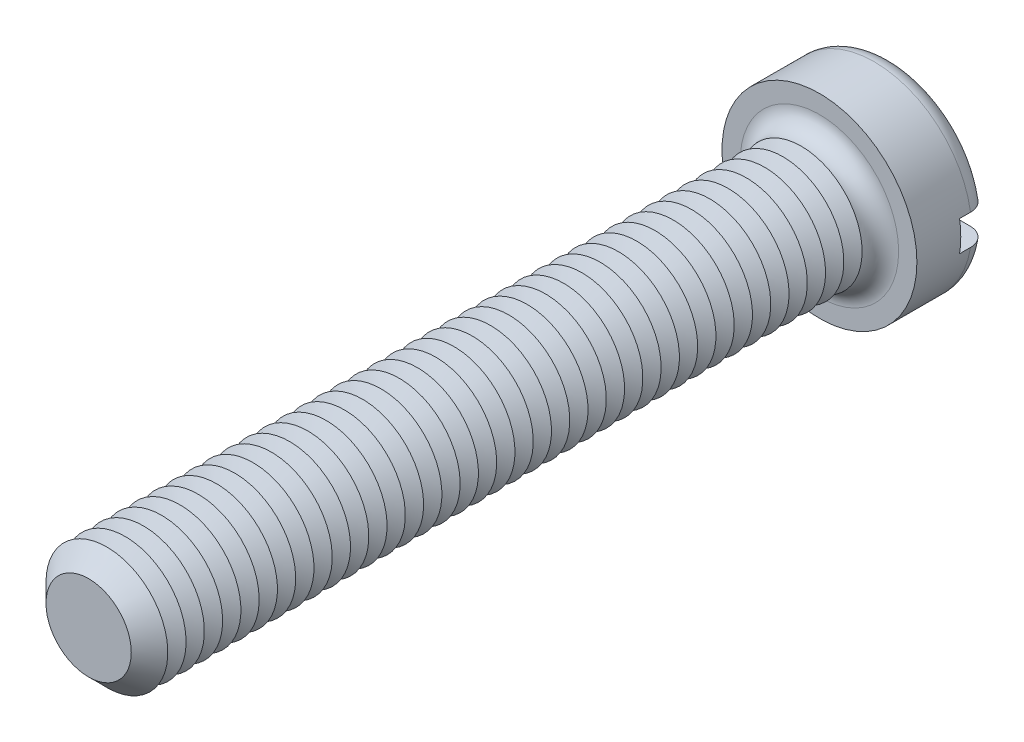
ISO-10303-21;
HEADER;
FILE_DESCRIPTION(('STEP AP214'),'2;1');
FILE_NAME('part.step','',(''),(''),'','','');
FILE_SCHEMA(('AUTOMOTIVE_DESIGN { 1 0 10303 214 1 1 1 1 }'));
ENDSEC;
DATA;
#1=APPLICATION_CONTEXT('core data for automotive mechanical design processes');
#2=APPLICATION_PROTOCOL_DEFINITION('international standard','automotive_design',2000,#1);
#3=PRODUCT_CONTEXT('',#1,'mechanical');
#4=PRODUCT('Part','Part','',(#3));
#5=PRODUCT_RELATED_PRODUCT_CATEGORY('part','',(#4));
#6=PRODUCT_DEFINITION_FORMATION('','',#4);
#7=PRODUCT_DEFINITION_CONTEXT('part definition',#1,'design');
#8=PRODUCT_DEFINITION('design','',#6,#7);
#9=PRODUCT_DEFINITION_SHAPE('','',#8);
#10=(LENGTH_UNIT() NAMED_UNIT(*) SI_UNIT(.MILLI.,.METRE.));
#11=(NAMED_UNIT(*) PLANE_ANGLE_UNIT() SI_UNIT($,.RADIAN.));
#12=(NAMED_UNIT(*) SI_UNIT($,.STERADIAN.) SOLID_ANGLE_UNIT());
#13=UNCERTAINTY_MEASURE_WITH_UNIT(LENGTH_MEASURE(1.E-05),#10,'distance_accuracy_value','');
#14=(GEOMETRIC_REPRESENTATION_CONTEXT(3) GLOBAL_UNCERTAINTY_ASSIGNED_CONTEXT((#13)) GLOBAL_UNIT_ASSIGNED_CONTEXT((#10,
#11,#12)) REPRESENTATION_CONTEXT('',''));
#15=CARTESIAN_POINT('',(0.,0.,0.));
#16=DIRECTION('',(0.,0.,1.));
#17=DIRECTION('',(1.,0.,0.));
#18=AXIS2_PLACEMENT_3D('',#15,#16,#17);
#19=CARTESIAN_POINT('',(0.,0.,-6.));
#20=DIRECTION('',(0.,0.,1.));
#21=DIRECTION('',(1.,0.,0.));
#22=AXIS2_PLACEMENT_3D('',#19,#20,#21);
#23=PLANE('',#22);
#24=CARTESIAN_POINT('',(0.,0.,-6.));
#25=DIRECTION('',(0.,0.,1.));
#26=DIRECTION('',(1.,0.,0.));
#27=AXIS2_PLACEMENT_3D('',#24,#25,#26);
#28=CIRCLE('',#27,6.5);
#29=CARTESIAN_POINT('',(-6.37867541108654,1.25,-6.));
#30=VERTEX_POINT('',#29);
#31=CARTESIAN_POINT('',(6.37867541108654,1.25,-6.));
#32=VERTEX_POINT('',#31);
#33=EDGE_CURVE('E116',#30,#32,#28,.F.);
#34=ORIENTED_EDGE('',*,*,#33,.T.);
#35=DIRECTION('',(1.,0.,0.));
#36=VECTOR('',#35,1.);
#37=CARTESIAN_POINT('',(-8.,1.25,-6.));
#38=LINE('',#37,#36);
#39=EDGE_CURVE('E111',#30,#32,#38,.T.);
#40=ORIENTED_EDGE('',*,*,#39,.F.);
#41=EDGE_LOOP('',(#34,#40));
#42=FACE_BOUND('',#41,.T.);
#43=ADVANCED_FACE('F39',(#42),#23,.F.);
#44=CARTESIAN_POINT('',(0.,0.,-4.5));
#45=DIRECTION('',(0.,0.,1.));
#46=DIRECTION('',(1.,0.,0.));
#47=AXIS2_PLACEMENT_3D('',#44,#45,#46);
#48=TOROIDAL_SURFACE('',#47,6.5,1.5);
#49=CARTESIAN_POINT('',(-7.63778128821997,1.25,-5.34492908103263));
#50=CARTESIAN_POINT('',(-7.58949199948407,1.25,-5.41482553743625));
#51=CARTESIAN_POINT('',(-7.53520056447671,1.25,-5.48065698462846));
#52=CARTESIAN_POINT('',(-7.41624971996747,1.25,-5.60228223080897));
#53=CARTESIAN_POINT('',(-7.35157642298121,1.25,-5.65806236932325));
#54=CARTESIAN_POINT('',(-7.21387612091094,1.25,-5.75795436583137));
#55=CARTESIAN_POINT('',(-7.14085828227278,1.25,-5.80207885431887));
#56=CARTESIAN_POINT('',(-6.98853766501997,1.25,-5.87758013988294));
#57=CARTESIAN_POINT('',(-6.90923642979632,1.25,-5.90896005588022));
#58=CARTESIAN_POINT('',(-6.74565677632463,1.25,-5.95849861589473));
#59=CARTESIAN_POINT('',(-6.66133328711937,1.25,-5.97650838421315));
#60=CARTESIAN_POINT('',(-6.49086565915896,1.25,-5.99833509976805));
#61=CARTESIAN_POINT('',(-6.40472129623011,1.25,-6.00215028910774));
#62=CARTESIAN_POINT('',(-6.23174891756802,1.25,-5.99550457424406));
#63=CARTESIAN_POINT('',(-6.14492874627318,1.25,-5.98483870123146));
#64=CARTESIAN_POINT('',(-5.97427268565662,1.25,-5.94920077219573));
#65=CARTESIAN_POINT('',(-5.89043699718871,1.25,-5.92422775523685));
#66=CARTESIAN_POINT('',(-5.72747580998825,1.25,-5.86041051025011));
#67=CARTESIAN_POINT('',(-5.64839123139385,1.25,-5.8214616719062));
#68=CARTESIAN_POINT('',(-5.49793182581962,1.25,-5.73076137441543));
#69=CARTESIAN_POINT('',(-5.42655700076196,1.25,-5.6790099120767));
#70=CARTESIAN_POINT('',(-5.29410028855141,1.25,-5.56444713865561));
#71=CARTESIAN_POINT('',(-5.23295591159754,1.25,-5.50170815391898));
#72=CARTESIAN_POINT('',(-5.12236155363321,1.25,-5.36664720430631));
#73=CARTESIAN_POINT('',(-5.07291010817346,1.25,-5.29432644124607));
#74=CARTESIAN_POINT('',(-4.98836421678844,1.25,-5.14389152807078));
#75=CARTESIAN_POINT('',(-4.95296843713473,1.25,-5.0659468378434));
#76=CARTESIAN_POINT('',(-4.89620356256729,1.25,-4.90510804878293));
#77=CARTESIAN_POINT('',(-4.87483169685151,1.25,-4.82221493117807));
#78=CARTESIAN_POINT('',(-4.8472995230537,1.25,-4.65636387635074));
#79=CARTESIAN_POINT('',(-4.84072446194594,1.25,-4.57347463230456));
#80=CARTESIAN_POINT('',(-4.84179430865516,1.25,-4.40779255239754));
#81=CARTESIAN_POINT('',(-4.84943782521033,1.25,-4.32499970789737));
#82=CARTESIAN_POINT('',(-4.87846819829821,1.25,-4.16301415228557));
#83=CARTESIAN_POINT('',(-4.89966978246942,1.25,-4.08378809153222));
#84=CARTESIAN_POINT('',(-4.95491528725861,1.25,-3.92995334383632));
#85=CARTESIAN_POINT('',(-4.98895983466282,1.25,-3.85534488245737));
#86=CARTESIAN_POINT('',(-5.06928242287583,1.25,-3.71183790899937));
#87=CARTESIAN_POINT('',(-5.11570495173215,1.25,-3.64302036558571));
#88=CARTESIAN_POINT('',(-5.21915370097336,1.25,-3.51388372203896));
#89=CARTESIAN_POINT('',(-5.27618132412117,1.25,-3.45356574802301));
#90=CARTESIAN_POINT('',(-5.40090076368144,1.25,-3.34137671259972));
#91=CARTESIAN_POINT('',(-5.46884305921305,1.25,-3.28978408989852));
#92=CARTESIAN_POINT('',(-5.61225757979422,1.25,-3.19841811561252));
#93=CARTESIAN_POINT('',(-5.68773079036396,1.25,-3.15864631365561));
#94=CARTESIAN_POINT('',(-5.84602026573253,1.25,-3.09111626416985));
#95=CARTESIAN_POINT('',(-5.92896901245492,1.25,-3.06366820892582));
#96=CARTESIAN_POINT('',(-6.09827849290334,1.25,-3.02294686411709));
#97=CARTESIAN_POINT('',(-6.18463944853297,1.25,-3.00967449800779));
#98=CARTESIAN_POINT('',(-6.35914138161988,1.25,-2.99765063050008));
#99=CARTESIAN_POINT('',(-6.4472913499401,1.25,-2.99902877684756));
#100=CARTESIAN_POINT('',(-6.62209547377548,1.25,-3.01665363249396));
#101=CARTESIAN_POINT('',(-6.70874965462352,1.25,-3.03290008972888));
#102=CARTESIAN_POINT('',(-6.87754008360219,1.25,-3.07975247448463));
#103=CARTESIAN_POINT('',(-6.95969991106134,1.25,-3.11027336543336));
#104=CARTESIAN_POINT('',(-7.11762200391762,1.25,-3.18486653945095));
#105=CARTESIAN_POINT('',(-7.19338469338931,1.25,-3.22893792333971));
#106=CARTESIAN_POINT('',(-7.33522754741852,1.25,-3.32873457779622));
#107=CARTESIAN_POINT('',(-7.40142768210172,1.25,-3.38428930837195));
#108=CARTESIAN_POINT('',(-7.52338344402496,1.25,-3.50587739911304));
#109=CARTESIAN_POINT('',(-7.5791399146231,1.25,-3.57190991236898));
#110=CARTESIAN_POINT('',(-7.67774856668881,1.25,-3.71151097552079));
#111=CARTESIAN_POINT('',(-7.72078137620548,1.25,-3.7849519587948));
#112=CARTESIAN_POINT('',(-7.79373860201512,1.25,-3.93807617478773));
#113=CARTESIAN_POINT('',(-7.82366445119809,1.25,-4.01775872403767));
#114=CARTESIAN_POINT('',(-7.86922494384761,1.25,-4.1801114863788));
#115=CARTESIAN_POINT('',(-7.88502105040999,1.25,-4.26273642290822));
#116=CARTESIAN_POINT('',(-7.90243332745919,1.25,-4.42948977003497));
#117=CARTESIAN_POINT('',(-7.90404643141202,1.25,-4.51361850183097));
#118=CARTESIAN_POINT('',(-7.89306914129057,1.25,-4.68049925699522));
#119=CARTESIAN_POINT('',(-7.88055163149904,1.25,-4.76325613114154));
#120=CARTESIAN_POINT('',(-7.84181179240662,1.25,-4.92542124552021));
#121=CARTESIAN_POINT('',(-7.81560657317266,1.25,-5.00483353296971));
#122=CARTESIAN_POINT('',(-7.76329893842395,1.25,-5.12766777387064));
#123=CARTESIAN_POINT('',(-7.74127773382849,1.25,-5.17287245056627));
#124=CARTESIAN_POINT('',(-7.69279783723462,1.25,-5.26083500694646));
#125=CARTESIAN_POINT('',(-7.66633917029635,1.25,-5.30359290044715));
#126=CARTESIAN_POINT('',(-7.63778128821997,1.25,-5.34492908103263));
#127=B_SPLINE_CURVE_WITH_KNOTS('',3,(#49,#50,#51,#52,#53,#54,#55,#56,#57,#58,#59,#60,#61,#62,
#63,#64,#65,#66,#67,#68,#69,#70,#71,#72,#73,#74,#75,#76,#77,#78,#79,#80,#81,#82,#83,#84,#85,#86,
#87,#88,#89,#90,#91,#92,#93,#94,#95,#96,#97,#98,#99,#100,#101,#102,#103,#104,#105,#106,#107,
#108,#109,#110,#111,#112,#113,#114,#115,#116,#117,#118,#119,#120,#121,#122,#123,#124,#125,#126),
.UNSPECIFIED.,.T.,.F.,(4,2,2,2,2,2,2,2,2,2,2,2,2,2,2,2,2,2,2,2,2,2,2,2,2,2,2,2,2,2,2,2,2,2,2,2,
2,2,4),(0.,0.254678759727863,0.509701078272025,0.764445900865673,1.01912834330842,
1.27660578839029,1.53411511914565,1.7953075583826,2.05651754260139,2.31972495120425,
2.58293242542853,2.84446831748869,3.10597143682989,3.36151874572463,3.61701554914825,
3.86525656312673,4.11347328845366,4.35836855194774,4.60327576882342,4.8511774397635,
5.0991119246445,5.35387584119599,5.60867314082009,5.86956650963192,6.13047687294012,
6.39369803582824,6.65691473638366,6.91858297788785,7.18023385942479,7.43824706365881,
7.69623942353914,7.95037087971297,8.20447454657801,8.45563599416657,8.70685174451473,
8.95677764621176,9.20639187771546,9.35700761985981,9.50762251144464),.UNSPECIFIED.);
#128=CARTESIAN_POINT('',(-7.90174031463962,1.25,-4.50000000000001));
#129=VERTEX_POINT('',#128);
#130=EDGE_CURVE('E483',#129,#30,#127,.T.);
#131=ORIENTED_EDGE('',*,*,#130,.F.);
#132=CARTESIAN_POINT('',(0.,0.,-4.5));
#133=DIRECTION('',(0.,0.,1.));
#134=DIRECTION('',(1.,0.,0.));
#135=AXIS2_PLACEMENT_3D('',#132,#133,#134);
#136=CIRCLE('',#135,8.);
#137=CARTESIAN_POINT('',(7.90174031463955,1.25,-4.5));
#138=VERTEX_POINT('',#137);
#139=EDGE_CURVE('E125',#138,#129,#136,.T.);
#140=ORIENTED_EDGE('',*,*,#139,.F.);
#141=CARTESIAN_POINT('',(4.95236709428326,1.25,-5.05808354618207));
#142=CARTESIAN_POINT('',(4.98477386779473,1.25,-5.13646278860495));
#143=CARTESIAN_POINT('',(5.02397623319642,1.25,-5.21210974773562));
#144=CARTESIAN_POINT('',(5.11464829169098,1.25,-5.35575180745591));
#145=CARTESIAN_POINT('',(5.16613670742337,1.25,-5.42373499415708));
#146=CARTESIAN_POINT('',(5.27963080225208,1.25,-5.55005899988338));
#147=CARTESIAN_POINT('',(5.34161871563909,1.25,-5.60841578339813));
#148=CARTESIAN_POINT('',(5.47431803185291,1.25,-5.71412381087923));
#149=CARTESIAN_POINT('',(5.545027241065,1.25,-5.76147781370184));
#150=CARTESIAN_POINT('',(5.69469818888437,1.25,-5.84486022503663));
#151=CARTESIAN_POINT('',(5.77379661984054,1.25,-5.88064336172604));
#152=CARTESIAN_POINT('',(5.93682776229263,1.25,-5.93863952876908));
#153=CARTESIAN_POINT('',(6.02076112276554,1.25,-5.96085073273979));
#154=CARTESIAN_POINT('',(6.19235911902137,1.25,-5.99130732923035));
#155=CARTESIAN_POINT('',(6.2800597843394,1.25,-5.99935025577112));
#156=CARTESIAN_POINT('',(6.45556807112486,1.25,-6.00057400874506));
#157=CARTESIAN_POINT('',(6.54337569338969,1.25,-5.99375472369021));
#158=CARTESIAN_POINT('',(6.71642471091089,1.25,-5.96539034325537));
#159=CARTESIAN_POINT('',(6.8016703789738,1.25,-5.94387137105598));
#160=CARTESIAN_POINT('',(6.96726399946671,1.25,-5.8866508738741));
#161=CARTESIAN_POINT('',(7.04761223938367,1.25,-5.85095018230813));
#162=CARTESIAN_POINT('',(7.2000703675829,1.25,-5.7668235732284));
#163=CARTESIAN_POINT('',(7.27226868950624,1.25,-5.71855796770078));
#164=CARTESIAN_POINT('',(7.40737382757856,1.25,-5.61041520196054));
#165=CARTESIAN_POINT('',(7.47028138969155,1.25,-5.55053897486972));
#166=CARTESIAN_POINT('',(7.5840004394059,1.25,-5.42185995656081));
#167=CARTESIAN_POINT('',(7.63498189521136,1.25,-5.35320736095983));
#168=CARTESIAN_POINT('',(7.72451646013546,1.25,-5.20822613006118));
#169=CARTESIAN_POINT('',(7.76307051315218,1.25,-5.13189807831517));
#170=CARTESIAN_POINT('',(7.82615156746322,1.25,-4.97479919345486));
#171=CARTESIAN_POINT('',(7.85085353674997,1.25,-4.89409858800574));
#172=CARTESIAN_POINT('',(7.88624162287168,1.25,-4.72968126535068));
#173=CARTESIAN_POINT('',(7.89692844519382,1.25,-4.64596470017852));
#174=CARTESIAN_POINT('',(7.90393395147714,1.25,-4.47857496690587));
#175=CARTESIAN_POINT('',(7.900361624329,1.25,-4.39490633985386));
#176=CARTESIAN_POINT('',(7.8792027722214,1.25,-4.22936201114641));
#177=CARTESIAN_POINT('',(7.86161649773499,1.25,-4.14748627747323));
#178=CARTESIAN_POINT('',(7.81298565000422,1.25,-3.98793539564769));
#179=CARTESIAN_POINT('',(7.78195585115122,1.25,-3.91025574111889));
#180=CARTESIAN_POINT('',(7.70736418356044,1.25,-3.76116938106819));
#181=CARTESIAN_POINT('',(7.66380211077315,1.25,-3.68976277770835));
#182=CARTESIAN_POINT('',(7.56515173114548,1.25,-3.55480889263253));
#183=CARTESIAN_POINT('',(7.51000119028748,1.25,-3.49130712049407));
#184=CARTESIAN_POINT('',(7.38992820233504,1.25,-3.3743390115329));
#185=CARTESIAN_POINT('',(7.32500529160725,1.25,-3.32087315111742));
#186=CARTESIAN_POINT('',(7.18646521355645,1.25,-3.22483712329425));
#187=CARTESIAN_POINT('',(7.11275872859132,1.25,-3.18239583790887));
#188=CARTESIAN_POINT('',(6.95934489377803,1.25,-3.11028530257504));
#189=CARTESIAN_POINT('',(6.87963710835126,1.25,-3.08061698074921));
#190=CARTESIAN_POINT('',(6.71523243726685,1.25,-3.03442872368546));
#191=CARTESIAN_POINT('',(6.63047940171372,1.25,-3.0181086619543));
#192=CARTESIAN_POINT('',(6.45944163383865,1.25,-2.99971307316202));
#193=CARTESIAN_POINT('',(6.37315677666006,1.25,-2.99763871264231));
#194=CARTESIAN_POINT('',(6.20021063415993,1.25,-3.00779604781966));
#195=CARTESIAN_POINT('',(6.11356117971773,1.25,-3.02022976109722));
#196=CARTESIAN_POINT('',(5.94354092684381,1.25,-3.05935975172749));
#197=CARTESIAN_POINT('',(5.86017035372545,1.25,-3.08605700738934));
#198=CARTESIAN_POINT('',(5.69848536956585,1.25,-3.15322746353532));
#199=CARTESIAN_POINT('',(5.62021039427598,1.25,-3.1937956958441));
#200=CARTESIAN_POINT('',(5.47164170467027,1.25,-3.28758816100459));
#201=CARTESIAN_POINT('',(5.40134797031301,1.25,-3.3408123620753));
#202=CARTESIAN_POINT('',(5.27136483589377,1.25,-3.45806317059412));
#203=CARTESIAN_POINT('',(5.21160120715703,1.25,-3.52200740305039));
#204=CARTESIAN_POINT('',(5.10396941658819,1.25,-3.65922833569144));
#205=CARTESIAN_POINT('',(5.05609917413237,1.25,-3.73250340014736));
#206=CARTESIAN_POINT('',(4.97487058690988,1.25,-3.8844714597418));
#207=CARTESIAN_POINT('',(4.94119529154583,1.25,-3.96299495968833));
#208=CARTESIAN_POINT('',(4.88793322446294,1.25,-4.12470694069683));
#209=CARTESIAN_POINT('',(4.86834741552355,1.25,-4.20789574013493));
#210=CARTESIAN_POINT('',(4.84433446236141,1.25,-4.3740749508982));
#211=CARTESIAN_POINT('',(4.83950391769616,1.25,-4.45700748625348));
#212=CARTESIAN_POINT('',(4.84404021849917,1.25,-4.62240731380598));
#213=CARTESIAN_POINT('',(4.85338770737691,1.25,-4.70487508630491));
#214=CARTESIAN_POINT('',(4.87895619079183,1.25,-4.83246978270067));
#215=CARTESIAN_POINT('',(4.89056704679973,1.25,-4.87856970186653));
#216=CARTESIAN_POINT('',(4.91819711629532,1.25,-4.96942661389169));
#217=CARTESIAN_POINT('',(4.93421619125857,1.25,-5.01418364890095));
#218=CARTESIAN_POINT('',(4.95236709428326,1.25,-5.05808354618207));
#219=B_SPLINE_CURVE_WITH_KNOTS('',3,(#141,#142,#143,#144,#145,#146,#147,#148,#149,#150,#151,
#152,#153,#154,#155,#156,#157,#158,#159,#160,#161,#162,#163,#164,#165,#166,#167,#168,#169,#170,
#171,#172,#173,#174,#175,#176,#177,#178,#179,#180,#181,#182,#183,#184,#185,#186,#187,#188,#189,
#190,#191,#192,#193,#194,#195,#196,#197,#198,#199,#200,#201,#202,#203,#204,#205,#206,#207,#208,
#209,#210,#211,#212,#213,#214,#215,#216,#217,#218),.UNSPECIFIED.,.T.,.F.,(4,2,2,2,2,2,2,2,2,2,2,
2,2,2,2,2,2,2,2,2,2,2,2,2,2,2,2,2,2,2,2,2,2,2,2,2,2,2,4),(0.,0.25426396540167,0.508917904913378,
0.763145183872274,1.01730864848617,1.27655188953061,1.53583000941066,1.79878406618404,
2.06174009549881,2.32423003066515,2.5867045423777,2.84598168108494,3.10523799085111,
3.36053725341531,3.61581712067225,3.8677953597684,4.11976091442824,4.36980428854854,
4.61984319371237,4.86960800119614,5.11937687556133,5.37052303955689,5.62168112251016,
5.87565515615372,6.12964764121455,6.38737709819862,6.64512765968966,6.90651052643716,
7.16791132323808,7.43114013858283,7.69436829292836,7.95565940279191,8.21690477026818,
8.47196060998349,8.72703387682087,8.97506819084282,9.22276418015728,9.36518087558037,
9.50759309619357),.UNSPECIFIED.);
#220=EDGE_CURVE('E485',#32,#138,#219,.T.);
#221=ORIENTED_EDGE('',*,*,#220,.F.);
#222=ORIENTED_EDGE('',*,*,#33,.F.);
#223=EDGE_LOOP('',(#131,#140,#221,#222));
#224=FACE_BOUND('',#223,.T.);
#225=ADVANCED_FACE('F467',(#224),#48,.T.);
#226=CARTESIAN_POINT('',(0.,0.,-6.));
#227=DIRECTION('',(0.,0.,1.));
#228=DIRECTION('',(1.,0.,0.));
#229=AXIS2_PLACEMENT_3D('',#226,#227,#228);
#230=CYLINDRICAL_SURFACE('',#229,8.);
#231=DIRECTION('',(0.,0.,1.));
#232=VECTOR('',#231,1.);
#233=CARTESIAN_POINT('',(7.90174031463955,1.25,-6.));
#234=LINE('',#233,#232);
#235=CARTESIAN_POINT('',(7.90174031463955,1.25,-3.6));
#236=VERTEX_POINT('',#235);
#237=EDGE_CURVE('E500',#138,#236,#234,.T.);
#238=ORIENTED_EDGE('',*,*,#237,.F.);
#239=ORIENTED_EDGE('',*,*,#139,.T.);
#240=DIRECTION('',(0.,0.,1.));
#241=VECTOR('',#240,1.);
#242=CARTESIAN_POINT('',(-7.90174031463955,1.25,-6.));
#243=LINE('',#242,#241);
#244=CARTESIAN_POINT('',(-7.90174031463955,1.25,-3.6));
#245=VERTEX_POINT('',#244);
#246=EDGE_CURVE('E63',#245,#129,#243,.F.);
#247=ORIENTED_EDGE('',*,*,#246,.F.);
#248=CARTESIAN_POINT('',(0.,0.,-3.6));
#249=DIRECTION('',(0.,0.,-1.));
#250=DIRECTION('',(-1.,0.,0.));
#251=AXIS2_PLACEMENT_3D('',#248,#249,#250);
#252=CIRCLE('',#251,8.);
#253=CARTESIAN_POINT('',(-7.90174031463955,-1.25,-3.6));
#254=VERTEX_POINT('',#253);
#255=EDGE_CURVE('E43',#245,#254,#252,.F.);
#256=ORIENTED_EDGE('',*,*,#255,.T.);
#257=DIRECTION('',(0.,0.,1.));
#258=VECTOR('',#257,1.);
#259=CARTESIAN_POINT('',(-7.90174031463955,-1.25,-6.));
#260=LINE('',#259,#258);
#261=CARTESIAN_POINT('',(-7.9017403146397,-1.25,-4.49999999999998));
#262=VERTEX_POINT('',#261);
#263=EDGE_CURVE('E497',#262,#254,#260,.T.);
#264=ORIENTED_EDGE('',*,*,#263,.F.);
#265=CARTESIAN_POINT('',(7.90174031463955,-1.25,-4.5));
#266=VERTEX_POINT('',#265);
#267=EDGE_CURVE('E127',#262,#266,#136,.T.);
#268=ORIENTED_EDGE('',*,*,#267,.T.);
#269=DIRECTION('',(0.,0.,1.));
#270=VECTOR('',#269,1.);
#271=CARTESIAN_POINT('',(7.90174031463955,-1.25,-6.));
#272=LINE('',#271,#270);
#273=CARTESIAN_POINT('',(7.90174031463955,-1.25,-3.6));
#274=VERTEX_POINT('',#273);
#275=EDGE_CURVE('E55',#274,#266,#272,.F.);
#276=ORIENTED_EDGE('',*,*,#275,.F.);
#277=EDGE_CURVE('E11',#274,#236,#252,.F.);
#278=ORIENTED_EDGE('',*,*,#277,.T.);
#279=EDGE_LOOP('',(#238,#239,#247,#256,#264,#268,#276,#278));
#280=FACE_BOUND('',#279,.T.);
#281=CARTESIAN_POINT('',(0.,0.,0.));
#282=DIRECTION('',(0.,0.,1.));
#283=DIRECTION('',(1.,0.,0.));
#284=AXIS2_PLACEMENT_3D('',#281,#282,#283);
#285=CIRCLE('',#284,8.);
#286=CARTESIAN_POINT('',(8.,0.,0.));
#287=VERTEX_POINT('',#286);
#288=EDGE_CURVE('E503',#287,#287,#285,.T.);
#289=ORIENTED_EDGE('',*,*,#288,.F.);
#290=EDGE_LOOP('',(#289));
#291=FACE_BOUND('',#290,.T.);
#292=ADVANCED_FACE('F463',(#280,#291),#230,.T.);
#293=CARTESIAN_POINT('',(6.37867541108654,-1.25,-6.));
#294=VERTEX_POINT('',#293);
#295=CARTESIAN_POINT('',(-6.37867541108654,-1.25,-6.));
#296=VERTEX_POINT('',#295);
#297=EDGE_CURVE('E109',#294,#296,#28,.F.);
#298=ORIENTED_EDGE('',*,*,#297,.T.);
#299=DIRECTION('',(-1.,0.,0.));
#300=VECTOR('',#299,1.);
#301=CARTESIAN_POINT('',(-8.,-1.25,-6.));
#302=LINE('',#301,#300);
#303=EDGE_CURVE('E96',#294,#296,#302,.T.);
#304=ORIENTED_EDGE('',*,*,#303,.F.);
#305=EDGE_LOOP('',(#298,#304));
#306=FACE_BOUND('',#305,.T.);
#307=ADVANCED_FACE('F108',(#306),#23,.F.);
#308=CARTESIAN_POINT('',(0.,0.,0.));
#309=DIRECTION('',(0.,0.,1.));
#310=DIRECTION('',(1.,0.,0.));
#311=AXIS2_PLACEMENT_3D('',#308,#309,#310);
#312=PLANE('',#311);
#313=CARTESIAN_POINT('',(0.,0.,0.));
#314=DIRECTION('',(0.,0.,1.));
#315=DIRECTION('',(1.,0.,0.));
#316=AXIS2_PLACEMENT_3D('',#313,#314,#315);
#317=CIRCLE('',#316,6.5);
#318=CARTESIAN_POINT('',(6.5,0.,0.));
#319=VERTEX_POINT('',#318);
#320=EDGE_CURVE('E115',#319,#319,#317,.F.);
#321=ORIENTED_EDGE('',*,*,#320,.T.);
#322=EDGE_LOOP('',(#321));
#323=FACE_BOUND('',#322,.T.);
#324=ORIENTED_EDGE('',*,*,#288,.T.);
#325=EDGE_LOOP('',(#324));
#326=FACE_BOUND('',#325,.T.);
#327=ADVANCED_FACE('F462',(#323,#326),#312,.T.);
#328=CARTESIAN_POINT('',(-7.63778128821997,-1.25,-5.34492908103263));
#329=CARTESIAN_POINT('',(-7.68527581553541,-1.25,-5.27616964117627));
#330=CARTESIAN_POINT('',(-7.72703224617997,-1.25,-5.20337764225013));
#331=CARTESIAN_POINT('',(-7.79778035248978,-1.25,-5.05176511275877));
#332=CARTESIAN_POINT('',(-7.82675823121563,-1.25,-4.97293817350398));
#333=CARTESIAN_POINT('',(-7.87103239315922,-1.25,-4.81153865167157));
#334=CARTESIAN_POINT('',(-7.8863313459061,-1.25,-4.72896680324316));
#335=CARTESIAN_POINT('',(-7.90278562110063,-1.25,-4.56244566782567));
#336=CARTESIAN_POINT('',(-7.90394420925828,-1.25,-4.4784967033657));
#337=CARTESIAN_POINT('',(-7.89211470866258,-1.25,-4.31190980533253));
#338=CARTESIAN_POINT('',(-7.87917806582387,-1.25,-4.22926821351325));
#339=CARTESIAN_POINT('',(-7.8396278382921,-1.25,-4.06732477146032));
#340=CARTESIAN_POINT('',(-7.81301388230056,-1.25,-3.98802301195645));
#341=CARTESIAN_POINT('',(-7.74686575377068,-1.25,-3.83490116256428));
#342=CARTESIAN_POINT('',(-7.70731700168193,-1.25,-3.76108737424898));
#343=CARTESIAN_POINT('',(-7.61647675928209,-1.25,-3.62108231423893));
#344=CARTESIAN_POINT('',(-7.56518496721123,-1.25,-3.55489123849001));
#345=CARTESIAN_POINT('',(-7.45192141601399,-1.25,-3.43145488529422));
#346=CARTESIAN_POINT('',(-7.3898717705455,-1.25,-3.37428109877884));
#347=CARTESIAN_POINT('',(-7.25715883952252,-1.25,-3.27100737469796));
#348=CARTESIAN_POINT('',(-7.18649507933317,-1.25,-3.22490804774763));
#349=CARTESIAN_POINT('',(-7.03760898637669,-1.25,-3.14445316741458));
#350=CARTESIAN_POINT('',(-6.95930204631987,-1.25,-3.1102542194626));
#351=CARTESIAN_POINT('',(-6.79811453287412,-1.25,-3.05526915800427));
#352=CARTESIAN_POINT('',(-6.71523359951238,-1.25,-3.03448410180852));
#353=CARTESIAN_POINT('',(-6.5459165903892,-1.25,-3.006592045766));
#354=CARTESIAN_POINT('',(-6.45944575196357,-1.25,-2.99969602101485));
#355=CARTESIAN_POINT('',(-6.28655568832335,-1.25,-3.00032465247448));
#356=CARTESIAN_POINT('',(-6.20013646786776,-1.25,-3.00785047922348));
#357=CARTESIAN_POINT('',(-6.02865505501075,-1.25,-3.03725742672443));
#358=CARTESIAN_POINT('',(-5.94362352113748,-1.25,-3.05931758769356));
#359=CARTESIAN_POINT('',(-5.77844448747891,-1.25,-3.11735373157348));
#360=CARTESIAN_POINT('',(-5.69829723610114,-1.25,-3.15333042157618));
#361=CARTESIAN_POINT('',(-5.54495924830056,-1.25,-3.23837037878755));
#362=CARTESIAN_POINT('',(-5.47178958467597,-1.25,-3.28747168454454));
#363=CARTESIAN_POINT('',(-5.33486536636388,-1.25,-3.39741183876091));
#364=CARTESIAN_POINT('',(-5.27111040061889,-1.25,-3.45825017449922));
#365=CARTESIAN_POINT('',(-5.15579778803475,-1.25,-3.58914722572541));
#366=CARTESIAN_POINT('',(-5.10409113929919,-1.25,-3.65907455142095));
#367=CARTESIAN_POINT('',(-5.01353659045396,-1.25,-3.8068142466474));
#368=CARTESIAN_POINT('',(-4.97468647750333,-1.25,-3.88462525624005));
#369=CARTESIAN_POINT('',(-4.91208858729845,-1.25,-4.04366636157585));
#370=CARTESIAN_POINT('',(-4.88795969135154,-1.25,-4.12474643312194));
#371=CARTESIAN_POINT('',(-4.85404909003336,-1.25,-4.28985038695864));
#372=CARTESIAN_POINT('',(-4.84426486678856,-1.25,-4.37387374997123));
#373=CARTESIAN_POINT('',(-4.83946276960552,-1.25,-4.54023897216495));
#374=CARTESIAN_POINT('',(-4.8440833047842,-1.25,-4.62257060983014));
#375=CARTESIAN_POINT('',(-4.86713763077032,-1.25,-4.78527148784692));
#376=CARTESIAN_POINT('',(-4.88557092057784,-1.25,-4.86564079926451));
#377=CARTESIAN_POINT('',(-4.9355229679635,-1.25,-5.02189555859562));
#378=CARTESIAN_POINT('',(-4.9669975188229,-1.25,-5.09779517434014));
#379=CARTESIAN_POINT('',(-5.04199393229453,-1.25,-5.24338322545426));
#380=CARTESIAN_POINT('',(-5.0855168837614,-1.25,-5.31307109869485));
#381=CARTESIAN_POINT('',(-5.18427540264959,-1.25,-5.44580979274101));
#382=CARTESIAN_POINT('',(-5.2397318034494,-1.25,-5.50869620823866));
#383=CARTESIAN_POINT('',(-5.36015301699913,-1.25,-5.62458635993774));
#384=CARTESIAN_POINT('',(-5.42511919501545,-1.25,-5.67758867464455));
#385=CARTESIAN_POINT('',(-5.56469412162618,-1.25,-5.7737610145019));
#386=CARTESIAN_POINT('',(-5.6395232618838,-1.25,-5.81661133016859));
#387=CARTESIAN_POINT('',(-5.79521544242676,-1.25,-5.8894110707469));
#388=CARTESIAN_POINT('',(-5.8760791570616,-1.25,-5.91935905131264));
#389=CARTESIAN_POINT('',(-6.04317815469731,-1.25,-5.9660059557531));
#390=CARTESIAN_POINT('',(-6.12948555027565,-1.25,-5.98244700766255));
#391=CARTESIAN_POINT('',(-6.30363462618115,-1.25,-6.00064866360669));
#392=CARTESIAN_POINT('',(-6.39147629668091,-1.25,-6.00240936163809));
#393=CARTESIAN_POINT('',(-6.5664192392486,-1.25,-5.9911248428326));
#394=CARTESIAN_POINT('',(-6.653518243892,-1.25,-5.9780442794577));
#395=CARTESIAN_POINT('',(-6.82426167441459,-1.25,-5.93729204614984));
#396=CARTESIAN_POINT('',(-6.90790538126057,-1.25,-5.90961735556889));
#397=CARTESIAN_POINT('',(-7.06846412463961,-1.25,-5.84071272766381));
#398=CARTESIAN_POINT('',(-7.14543542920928,-1.25,-5.79961377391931));
#399=CARTESIAN_POINT('',(-7.29116896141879,-1.25,-5.70491210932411));
#400=CARTESIAN_POINT('',(-7.35994165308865,-1.25,-5.65132560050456));
#401=CARTESIAN_POINT('',(-7.46362894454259,-1.25,-5.55509815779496));
#402=CARTESIAN_POINT('',(-7.50165191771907,-1.25,-5.51575032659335));
#403=CARTESIAN_POINT('',(-7.57319530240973,-1.25,-5.43315308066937));
#404=CARTESIAN_POINT('',(-7.60671575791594,-1.25,-5.38990370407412));
#405=CARTESIAN_POINT('',(-7.63778128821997,-1.25,-5.34492908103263));
#406=B_SPLINE_CURVE_WITH_KNOTS('',3,(#328,#329,#330,#331,#332,#333,#334,#335,#336,#337,#338,
#339,#340,#341,#342,#343,#344,#345,#346,#347,#348,#349,#350,#351,#352,#353,#354,#355,#356,#357,
#358,#359,#360,#361,#362,#363,#364,#365,#366,#367,#368,#369,#370,#371,#372,#373,#374,#375,#376,
#377,#378,#379,#380,#381,#382,#383,#384,#385,#386,#387,#388,#389,#390,#391,#392,#393,#394,#395,
#396,#397,#398,#399,#400,#401,#402,#403,#404,#405),.UNSPECIFIED.,.T.,.F.,(4,2,2,2,2,2,2,2,2,2,2,
2,2,2,2,2,2,2,2,2,2,2,2,2,2,2,2,2,2,2,2,2,2,2,2,2,2,2,4),(0.,0.250506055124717,
0.501281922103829,0.752008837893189,1.00267784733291,1.25243500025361,1.50219893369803,
1.75224536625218,2.00229822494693,2.25424343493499,2.50620253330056,2.76136198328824,
3.01654154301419,3.27556891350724,3.53461730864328,3.79691797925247,4.05923197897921,
4.32231463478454,4.5853858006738,4.84500678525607,5.10458306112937,5.3571172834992,
5.60960717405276,5.85581050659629,6.10200490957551,6.34737151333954,6.59276029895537,
6.84315522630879,7.09358613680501,7.35108485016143,7.60861238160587,7.87094926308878,
8.13328446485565,8.39624576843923,8.65926152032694,8.91978401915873,9.17997036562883,
9.34382460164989,9.50767723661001),.UNSPECIFIED.);
#407=EDGE_CURVE('E103',#296,#262,#406,.T.);
#408=ORIENTED_EDGE('',*,*,#407,.F.);
#409=ORIENTED_EDGE('',*,*,#297,.F.);
#410=CARTESIAN_POINT('',(4.95236709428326,-1.25,-5.05808354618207));
#411=CARTESIAN_POINT('',(4.92105512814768,-1.25,-4.98233216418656));
#412=CARTESIAN_POINT('',(4.89604361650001,-1.25,-4.90392040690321));
#413=CARTESIAN_POINT('',(4.85951223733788,-1.25,-4.74395758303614));
#414=CARTESIAN_POINT('',(4.8480045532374,-1.25,-4.66240375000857));
#415=CARTESIAN_POINT('',(4.83891469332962,-1.25,-4.49852199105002));
#416=CARTESIAN_POINT('',(4.84133145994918,-1.25,-4.41619412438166));
#417=CARTESIAN_POINT('',(4.8600038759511,-1.25,-4.25314313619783));
#418=CARTESIAN_POINT('',(4.87625705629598,-1.25,-4.17241973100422));
#419=CARTESIAN_POINT('',(4.92196554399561,-1.25,-4.01505032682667));
#420=CARTESIAN_POINT('',(4.95138456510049,-1.25,-3.93839376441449));
#421=CARTESIAN_POINT('',(5.02244158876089,-1.25,-3.79097367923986));
#422=CARTESIAN_POINT('',(5.06408092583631,-1.25,-3.72021080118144));
#423=CARTESIAN_POINT('',(5.15918188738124,-1.25,-3.5851203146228));
#424=CARTESIAN_POINT('',(5.21285223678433,-1.25,-3.5209397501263));
#425=CARTESIAN_POINT('',(5.32993512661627,-1.25,-3.40218700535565));
#426=CARTESIAN_POINT('',(5.39334903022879,-1.25,-3.34761617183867));
#427=CARTESIAN_POINT('',(5.5300552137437,-1.25,-3.24801679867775));
#428=CARTESIAN_POINT('',(5.60357647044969,-1.25,-3.20330242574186));
#429=CARTESIAN_POINT('',(5.75697062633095,-1.25,-3.1265687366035));
#430=CARTESIAN_POINT('',(5.83684424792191,-1.25,-3.09455086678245));
#431=CARTESIAN_POINT('',(6.00239031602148,-1.25,-3.04353393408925));
#432=CARTESIAN_POINT('',(6.08814636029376,-1.25,-3.02480570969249));
#433=CARTESIAN_POINT('',(6.26158564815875,-1.25,-3.00194915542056));
#434=CARTESIAN_POINT('',(6.34926896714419,-1.25,-2.997821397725));
#435=CARTESIAN_POINT('',(6.52441816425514,-1.25,-3.00435236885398));
#436=CARTESIAN_POINT('',(6.61188199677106,-1.25,-3.01506655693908));
#437=CARTESIAN_POINT('',(6.78373130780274,-1.25,-3.05116556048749));
#438=CARTESIAN_POINT('',(6.8681168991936,-1.25,-3.07654983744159));
#439=CARTESIAN_POINT('',(7.03056473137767,-1.25,-3.14105639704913));
#440=CARTESIAN_POINT('',(7.10867812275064,-1.25,-3.18004978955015));
#441=CARTESIAN_POINT('',(7.25711285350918,-1.25,-3.27078804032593));
#442=CARTESIAN_POINT('',(7.327434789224,-1.25,-3.32253192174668));
#443=CARTESIAN_POINT('',(7.45716954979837,-1.25,-3.4364775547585));
#444=CARTESIAN_POINT('',(7.51672925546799,-1.25,-3.49851206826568));
#445=CARTESIAN_POINT('',(7.62440498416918,-1.25,-3.63182557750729));
#446=CARTESIAN_POINT('',(7.67252193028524,-1.25,-3.70310382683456));
#447=CARTESIAN_POINT('',(7.75523498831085,-1.25,-3.8517825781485));
#448=CARTESIAN_POINT('',(7.79001407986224,-1.25,-3.92908131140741));
#449=CARTESIAN_POINT('',(7.84595474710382,-1.25,-4.08845836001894));
#450=CARTESIAN_POINT('',(7.86711715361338,-1.25,-4.1705363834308));
#451=CARTESIAN_POINT('',(7.89503817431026,-1.25,-4.3362768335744));
#452=CARTESIAN_POINT('',(7.90193595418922,-1.25,-4.41991584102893));
#453=CARTESIAN_POINT('',(7.90153623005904,-1.25,-4.58715860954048));
#454=CARTESIAN_POINT('',(7.89423915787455,-1.25,-4.67076237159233));
#455=CARTESIAN_POINT('',(7.86572271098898,-1.25,-4.83525080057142));
#456=CARTESIAN_POINT('',(7.84455307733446,-1.25,-4.91614410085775));
#457=CARTESIAN_POINT('',(7.78897430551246,-1.25,-5.0732444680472));
#458=CARTESIAN_POINT('',(7.75456511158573,-1.25,-5.1494515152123));
#459=CARTESIAN_POINT('',(7.67339923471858,-1.25,-5.29528903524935));
#460=CARTESIAN_POINT('',(7.62660424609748,-1.25,-5.36489817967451));
#461=CARTESIAN_POINT('',(7.52209201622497,-1.25,-5.49536318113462));
#462=CARTESIAN_POINT('',(7.4643743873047,-1.25,-5.55621872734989));
#463=CARTESIAN_POINT('',(7.33909994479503,-1.25,-5.66807257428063));
#464=CARTESIAN_POINT('',(7.27145672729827,-1.25,-5.71897407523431));
#465=CARTESIAN_POINT('',(7.12868060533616,-1.25,-5.80887807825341));
#466=CARTESIAN_POINT('',(7.0535472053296,-1.25,-5.84787979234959));
#467=CARTESIAN_POINT('',(6.89682225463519,-1.25,-5.91345911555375));
#468=CARTESIAN_POINT('',(6.81515596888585,-1.25,-5.93985808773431));
#469=CARTESIAN_POINT('',(6.64858434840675,-1.25,-5.97879449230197));
#470=CARTESIAN_POINT('',(6.56367874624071,-1.25,-5.99133077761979));
#471=CARTESIAN_POINT('',(6.39168259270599,-1.25,-6.00236627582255));
#472=CARTESIAN_POINT('',(6.30457835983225,-1.25,-6.00065255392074));
#473=CARTESIAN_POINT('',(6.13186422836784,-1.25,-5.98278857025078));
#474=CARTESIAN_POINT('',(6.04625438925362,-1.25,-5.96663773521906));
#475=CARTESIAN_POINT('',(5.87802521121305,-1.25,-5.92012173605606));
#476=CARTESIAN_POINT('',(5.79544617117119,-1.25,-5.88961066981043));
#477=CARTESIAN_POINT('',(5.63656223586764,-1.25,-5.81513349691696));
#478=CARTESIAN_POINT('',(5.56025908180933,-1.25,-5.77116367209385));
#479=CARTESIAN_POINT('',(5.4162607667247,-1.25,-5.67098882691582));
#480=CARTESIAN_POINT('',(5.34855795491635,-1.25,-5.61479480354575));
#481=CARTESIAN_POINT('',(5.22382615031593,-1.25,-5.49168804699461));
#482=CARTESIAN_POINT('',(5.16678340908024,-1.25,-5.42478932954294));
#483=CARTESIAN_POINT('',(5.08326589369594,-1.25,-5.3075481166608));
#484=CARTESIAN_POINT('',(5.05313168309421,-1.25,-5.25976959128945));
#485=CARTESIAN_POINT('',(4.99845900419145,-1.25,-5.16110869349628));
#486=CARTESIAN_POINT('',(4.9739204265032,-1.25,-5.11022638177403));
#487=CARTESIAN_POINT('',(4.95236709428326,-1.25,-5.05808354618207));
#488=B_SPLINE_CURVE_WITH_KNOTS('',3,(#410,#411,#412,#413,#414,#415,#416,#417,#418,#419,#420,
#421,#422,#423,#424,#425,#426,#427,#428,#429,#430,#431,#432,#433,#434,#435,#436,#437,#438,#439,
#440,#441,#442,#443,#444,#445,#446,#447,#448,#449,#450,#451,#452,#453,#454,#455,#456,#457,#458,
#459,#460,#461,#462,#463,#464,#465,#466,#467,#468,#469,#470,#471,#472,#473,#474,#475,#476,#477,
#478,#479,#480,#481,#482,#483,#484,#485,#486,#487),.UNSPECIFIED.,.T.,.F.,(4,2,2,2,2,2,2,2,2,2,2,
2,2,2,2,2,2,2,2,2,2,2,2,2,2,2,2,2,2,2,2,2,2,2,2,2,2,2,4),(0.,0.245701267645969,
0.491624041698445,0.737528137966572,0.983388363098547,1.22857510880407,1.47378864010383,
1.72364048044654,1.97352730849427,2.2304941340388,2.48749022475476,2.74958408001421,
3.01168820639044,3.2747743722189,3.53785088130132,3.79850056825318,4.05913029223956,
4.31587819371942,4.57260537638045,4.82567253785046,5.07872425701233,5.32929532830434,
5.57985877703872,5.82952869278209,6.07919966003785,6.32965199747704,6.58011322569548,
6.8329006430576,7.08570479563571,7.3419930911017,7.59830259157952,7.85844887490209,
8.11860548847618,8.38146435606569,8.64439590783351,8.90709189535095,9.16944670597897,
9.33857644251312,9.5077028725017),.UNSPECIFIED.);
#489=EDGE_CURVE('E92',#266,#294,#488,.T.);
#490=ORIENTED_EDGE('',*,*,#489,.F.);
#491=ORIENTED_EDGE('',*,*,#267,.F.);
#492=EDGE_LOOP('',(#408,#409,#490,#491));
#493=FACE_BOUND('',#492,.T.);
#494=ADVANCED_FACE('F113',(#493),#48,.T.);
#495=CARTESIAN_POINT('',(0.,0.,1.5));
#496=DIRECTION('',(0.,0.,1.));
#497=DIRECTION('',(1.,0.,0.));
#498=AXIS2_PLACEMENT_3D('',#495,#496,#497);
#499=TOROIDAL_SURFACE('',#498,6.5,1.5);
#500=ORIENTED_EDGE('',*,*,#320,.F.);
#501=EDGE_LOOP('',(#500));
#502=FACE_BOUND('',#501,.T.);
#503=CARTESIAN_POINT('',(0.,0.,1.5));
#504=DIRECTION('',(0.,0.,-1.));
#505=DIRECTION('',(-1.,0.,0.));
#506=AXIS2_PLACEMENT_3D('',#503,#504,#505);
#507=CIRCLE('',#506,5.);
#508=CARTESIAN_POINT('',(-5.,0.,1.5));
#509=VERTEX_POINT('',#508);
#510=EDGE_CURVE('E508',#509,#509,#507,.T.);
#511=ORIENTED_EDGE('',*,*,#510,.T.);
#512=EDGE_LOOP('',(#511));
#513=FACE_BOUND('',#512,.T.);
#514=ADVANCED_FACE('F455',(#502,#513),#499,.F.);
#515=CARTESIAN_POINT('',(0.,0.,2.25));
#516=DIRECTION('',(0.,0.,-1.));
#517=DIRECTION('',(-1.,0.,0.));
#518=AXIS2_PLACEMENT_3D('',#515,#516,#517);
#519=CONICAL_SURFACE('',#518,3.70096189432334,1.0471975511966);
#520=ORIENTED_EDGE('',*,*,#510,.F.);
#521=EDGE_LOOP('',(#520));
#522=FACE_BOUND('',#521,.T.);
#523=CARTESIAN_POINT('',(0.,0.,2.25));
#524=DIRECTION('',(0.,0.,-1.));
#525=DIRECTION('',(-1.,0.,0.));
#526=AXIS2_PLACEMENT_3D('',#523,#524,#525);
#527=CIRCLE('',#526,3.70096189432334);
#528=CARTESIAN_POINT('',(-3.70096189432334,0.,2.25));
#529=VERTEX_POINT('',#528);
#530=EDGE_CURVE('E514',#529,#529,#527,.T.);
#531=ORIENTED_EDGE('',*,*,#530,.T.);
#532=EDGE_LOOP('',(#531));
#533=FACE_BOUND('',#532,.T.);
#534=ADVANCED_FACE('F451',(#522,#533),#519,.T.);
#535=CARTESIAN_POINT('',(0.,0.,3.));
#536=DIRECTION('',(0.,0.,1.));
#537=DIRECTION('',(1.,0.,0.));
#538=AXIS2_PLACEMENT_3D('',#535,#536,#537);
#539=CONICAL_SURFACE('',#538,5.,1.0471975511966);
#540=ORIENTED_EDGE('',*,*,#530,.F.);
#541=EDGE_LOOP('',(#540));
#542=FACE_BOUND('',#541,.T.);
#543=CARTESIAN_POINT('',(0.,0.,3.));
#544=DIRECTION('',(0.,0.,-1.));
#545=DIRECTION('',(-1.,0.,0.));
#546=AXIS2_PLACEMENT_3D('',#543,#544,#545);
#547=CIRCLE('',#546,5.);
#548=CARTESIAN_POINT('',(-5.,0.,3.));
#549=VERTEX_POINT('',#548);
#550=EDGE_CURVE('E520',#549,#549,#547,.T.);
#551=ORIENTED_EDGE('',*,*,#550,.T.);
#552=EDGE_LOOP('',(#551));
#553=FACE_BOUND('',#552,.T.);
#554=ADVANCED_FACE('F447',(#542,#553),#539,.T.);
#555=CARTESIAN_POINT('',(0.,0.,3.75));
#556=DIRECTION('',(0.,0.,-1.));
#557=DIRECTION('',(-1.,0.,0.));
#558=AXIS2_PLACEMENT_3D('',#555,#556,#557);
#559=CONICAL_SURFACE('',#558,3.70096189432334,1.0471975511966);
#560=ORIENTED_EDGE('',*,*,#550,.F.);
#561=EDGE_LOOP('',(#560));
#562=FACE_BOUND('',#561,.T.);
#563=CARTESIAN_POINT('',(0.,0.,3.75));
#564=DIRECTION('',(0.,0.,-1.));
#565=DIRECTION('',(-1.,0.,0.));
#566=AXIS2_PLACEMENT_3D('',#563,#564,#565);
#567=CIRCLE('',#566,3.70096189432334);
#568=CARTESIAN_POINT('',(-3.70096189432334,0.,3.75));
#569=VERTEX_POINT('',#568);
#570=EDGE_CURVE('E524',#569,#569,#567,.T.);
#571=ORIENTED_EDGE('',*,*,#570,.T.);
#572=EDGE_LOOP('',(#571));
#573=FACE_BOUND('',#572,.T.);
#574=ADVANCED_FACE('F443',(#562,#573),#559,.T.);
#575=CARTESIAN_POINT('',(0.,0.,4.5));
#576=DIRECTION('',(0.,0.,1.));
#577=DIRECTION('',(1.,0.,0.));
#578=AXIS2_PLACEMENT_3D('',#575,#576,#577);
#579=CONICAL_SURFACE('',#578,5.,1.0471975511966);
#580=ORIENTED_EDGE('',*,*,#570,.F.);
#581=EDGE_LOOP('',(#580));
#582=FACE_BOUND('',#581,.T.);
#583=CARTESIAN_POINT('',(0.,0.,4.5));
#584=DIRECTION('',(0.,0.,-1.));
#585=DIRECTION('',(-1.,0.,0.));
#586=AXIS2_PLACEMENT_3D('',#583,#584,#585);
#587=CIRCLE('',#586,5.);
#588=CARTESIAN_POINT('',(-5.,0.,4.5));
#589=VERTEX_POINT('',#588);
#590=EDGE_CURVE('E528',#589,#589,#587,.T.);
#591=ORIENTED_EDGE('',*,*,#590,.T.);
#592=EDGE_LOOP('',(#591));
#593=FACE_BOUND('',#592,.T.);
#594=ADVANCED_FACE('F439',(#582,#593),#579,.T.);
#595=CARTESIAN_POINT('',(0.,0.,5.25));
#596=DIRECTION('',(0.,0.,-1.));
#597=DIRECTION('',(-1.,0.,0.));
#598=AXIS2_PLACEMENT_3D('',#595,#596,#597);
#599=CONICAL_SURFACE('',#598,3.70096189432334,1.0471975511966);
#600=ORIENTED_EDGE('',*,*,#590,.F.);
#601=EDGE_LOOP('',(#600));
#602=FACE_BOUND('',#601,.T.);
#603=CARTESIAN_POINT('',(0.,0.,5.25));
#604=DIRECTION('',(0.,0.,-1.));
#605=DIRECTION('',(-1.,0.,0.));
#606=AXIS2_PLACEMENT_3D('',#603,#604,#605);
#607=CIRCLE('',#606,3.70096189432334);
#608=CARTESIAN_POINT('',(-3.70096189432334,0.,5.25));
#609=VERTEX_POINT('',#608);
#610=EDGE_CURVE('E532',#609,#609,#607,.T.);
#611=ORIENTED_EDGE('',*,*,#610,.T.);
#612=EDGE_LOOP('',(#611));
#613=FACE_BOUND('',#612,.T.);
#614=ADVANCED_FACE('F435',(#602,#613),#599,.T.);
#615=CARTESIAN_POINT('',(0.,0.,6.));
#616=DIRECTION('',(0.,0.,1.));
#617=DIRECTION('',(1.,0.,0.));
#618=AXIS2_PLACEMENT_3D('',#615,#616,#617);
#619=CONICAL_SURFACE('',#618,5.,1.0471975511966);
#620=ORIENTED_EDGE('',*,*,#610,.F.);
#621=EDGE_LOOP('',(#620));
#622=FACE_BOUND('',#621,.T.);
#623=CARTESIAN_POINT('',(0.,0.,6.));
#624=DIRECTION('',(0.,0.,-1.));
#625=DIRECTION('',(-1.,0.,0.));
#626=AXIS2_PLACEMENT_3D('',#623,#624,#625);
#627=CIRCLE('',#626,5.);
#628=CARTESIAN_POINT('',(-5.,0.,6.));
#629=VERTEX_POINT('',#628);
#630=EDGE_CURVE('E536',#629,#629,#627,.T.);
#631=ORIENTED_EDGE('',*,*,#630,.T.);
#632=EDGE_LOOP('',(#631));
#633=FACE_BOUND('',#632,.T.);
#634=ADVANCED_FACE('F431',(#622,#633),#619,.T.);
#635=CARTESIAN_POINT('',(0.,0.,6.75));
#636=DIRECTION('',(0.,0.,-1.));
#637=DIRECTION('',(-1.,0.,0.));
#638=AXIS2_PLACEMENT_3D('',#635,#636,#637);
#639=CONICAL_SURFACE('',#638,3.70096189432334,1.0471975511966);
#640=ORIENTED_EDGE('',*,*,#630,.F.);
#641=EDGE_LOOP('',(#640));
#642=FACE_BOUND('',#641,.T.);
#643=CARTESIAN_POINT('',(0.,0.,6.75));
#644=DIRECTION('',(0.,0.,-1.));
#645=DIRECTION('',(-1.,0.,0.));
#646=AXIS2_PLACEMENT_3D('',#643,#644,#645);
#647=CIRCLE('',#646,3.70096189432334);
#648=CARTESIAN_POINT('',(-3.70096189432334,0.,6.75));
#649=VERTEX_POINT('',#648);
#650=EDGE_CURVE('E540',#649,#649,#647,.T.);
#651=ORIENTED_EDGE('',*,*,#650,.T.);
#652=EDGE_LOOP('',(#651));
#653=FACE_BOUND('',#652,.T.);
#654=ADVANCED_FACE('F427',(#642,#653),#639,.T.);
#655=CARTESIAN_POINT('',(0.,0.,7.5));
#656=DIRECTION('',(0.,0.,1.));
#657=DIRECTION('',(1.,0.,0.));
#658=AXIS2_PLACEMENT_3D('',#655,#656,#657);
#659=CONICAL_SURFACE('',#658,5.,1.0471975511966);
#660=ORIENTED_EDGE('',*,*,#650,.F.);
#661=EDGE_LOOP('',(#660));
#662=FACE_BOUND('',#661,.T.);
#663=CARTESIAN_POINT('',(0.,0.,7.5));
#664=DIRECTION('',(0.,0.,-1.));
#665=DIRECTION('',(-1.,0.,0.));
#666=AXIS2_PLACEMENT_3D('',#663,#664,#665);
#667=CIRCLE('',#666,5.);
#668=CARTESIAN_POINT('',(-5.,0.,7.5));
#669=VERTEX_POINT('',#668);
#670=EDGE_CURVE('E544',#669,#669,#667,.T.);
#671=ORIENTED_EDGE('',*,*,#670,.T.);
#672=EDGE_LOOP('',(#671));
#673=FACE_BOUND('',#672,.T.);
#674=ADVANCED_FACE('F423',(#662,#673),#659,.T.);
#675=CARTESIAN_POINT('',(0.,0.,8.25));
#676=DIRECTION('',(0.,0.,-1.));
#677=DIRECTION('',(-1.,0.,0.));
#678=AXIS2_PLACEMENT_3D('',#675,#676,#677);
#679=CONICAL_SURFACE('',#678,3.70096189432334,1.0471975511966);
#680=ORIENTED_EDGE('',*,*,#670,.F.);
#681=EDGE_LOOP('',(#680));
#682=FACE_BOUND('',#681,.T.);
#683=CARTESIAN_POINT('',(0.,0.,8.25));
#684=DIRECTION('',(0.,0.,-1.));
#685=DIRECTION('',(-1.,0.,0.));
#686=AXIS2_PLACEMENT_3D('',#683,#684,#685);
#687=CIRCLE('',#686,3.70096189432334);
#688=CARTESIAN_POINT('',(-3.70096189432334,0.,8.25));
#689=VERTEX_POINT('',#688);
#690=EDGE_CURVE('E548',#689,#689,#687,.T.);
#691=ORIENTED_EDGE('',*,*,#690,.T.);
#692=EDGE_LOOP('',(#691));
#693=FACE_BOUND('',#692,.T.);
#694=ADVANCED_FACE('F419',(#682,#693),#679,.T.);
#695=CARTESIAN_POINT('',(0.,0.,9.));
#696=DIRECTION('',(0.,0.,1.));
#697=DIRECTION('',(1.,0.,0.));
#698=AXIS2_PLACEMENT_3D('',#695,#696,#697);
#699=CONICAL_SURFACE('',#698,5.,1.0471975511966);
#700=ORIENTED_EDGE('',*,*,#690,.F.);
#701=EDGE_LOOP('',(#700));
#702=FACE_BOUND('',#701,.T.);
#703=CARTESIAN_POINT('',(0.,0.,9.));
#704=DIRECTION('',(0.,0.,-1.));
#705=DIRECTION('',(-1.,0.,0.));
#706=AXIS2_PLACEMENT_3D('',#703,#704,#705);
#707=CIRCLE('',#706,5.);
#708=CARTESIAN_POINT('',(-5.,0.,9.));
#709=VERTEX_POINT('',#708);
#710=EDGE_CURVE('E552',#709,#709,#707,.T.);
#711=ORIENTED_EDGE('',*,*,#710,.T.);
#712=EDGE_LOOP('',(#711));
#713=FACE_BOUND('',#712,.T.);
#714=ADVANCED_FACE('F415',(#702,#713),#699,.T.);
#715=CARTESIAN_POINT('',(0.,0.,9.75));
#716=DIRECTION('',(0.,0.,-1.));
#717=DIRECTION('',(-1.,0.,0.));
#718=AXIS2_PLACEMENT_3D('',#715,#716,#717);
#719=CONICAL_SURFACE('',#718,3.70096189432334,1.0471975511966);
#720=ORIENTED_EDGE('',*,*,#710,.F.);
#721=EDGE_LOOP('',(#720));
#722=FACE_BOUND('',#721,.T.);
#723=CARTESIAN_POINT('',(0.,0.,9.75));
#724=DIRECTION('',(0.,0.,-1.));
#725=DIRECTION('',(-1.,0.,0.));
#726=AXIS2_PLACEMENT_3D('',#723,#724,#725);
#727=CIRCLE('',#726,3.70096189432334);
#728=CARTESIAN_POINT('',(-3.70096189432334,0.,9.75));
#729=VERTEX_POINT('',#728);
#730=EDGE_CURVE('E555',#729,#729,#727,.T.);
#731=ORIENTED_EDGE('',*,*,#730,.T.);
#732=EDGE_LOOP('',(#731));
#733=FACE_BOUND('',#732,.T.);
#734=ADVANCED_FACE('F411',(#722,#733),#719,.T.);
#735=CARTESIAN_POINT('',(0.,0.,10.5));
#736=DIRECTION('',(0.,0.,1.));
#737=DIRECTION('',(1.,0.,0.));
#738=AXIS2_PLACEMENT_3D('',#735,#736,#737);
#739=CONICAL_SURFACE('',#738,5.,1.0471975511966);
#740=ORIENTED_EDGE('',*,*,#730,.F.);
#741=EDGE_LOOP('',(#740));
#742=FACE_BOUND('',#741,.T.);
#743=CARTESIAN_POINT('',(0.,0.,10.5));
#744=DIRECTION('',(0.,0.,-1.));
#745=DIRECTION('',(-1.,0.,0.));
#746=AXIS2_PLACEMENT_3D('',#743,#744,#745);
#747=CIRCLE('',#746,5.);
#748=CARTESIAN_POINT('',(-5.,0.,10.5));
#749=VERTEX_POINT('',#748);
#750=EDGE_CURVE('E559',#749,#749,#747,.T.);
#751=ORIENTED_EDGE('',*,*,#750,.T.);
#752=EDGE_LOOP('',(#751));
#753=FACE_BOUND('',#752,.T.);
#754=ADVANCED_FACE('F407',(#742,#753),#739,.T.);
#755=CARTESIAN_POINT('',(0.,0.,11.25));
#756=DIRECTION('',(0.,0.,-1.));
#757=DIRECTION('',(-1.,0.,0.));
#758=AXIS2_PLACEMENT_3D('',#755,#756,#757);
#759=CONICAL_SURFACE('',#758,3.70096189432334,1.0471975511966);
#760=ORIENTED_EDGE('',*,*,#750,.F.);
#761=EDGE_LOOP('',(#760));
#762=FACE_BOUND('',#761,.T.);
#763=CARTESIAN_POINT('',(0.,0.,11.25));
#764=DIRECTION('',(0.,0.,-1.));
#765=DIRECTION('',(-1.,0.,0.));
#766=AXIS2_PLACEMENT_3D('',#763,#764,#765);
#767=CIRCLE('',#766,3.70096189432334);
#768=CARTESIAN_POINT('',(-3.70096189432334,0.,11.25));
#769=VERTEX_POINT('',#768);
#770=EDGE_CURVE('E562',#769,#769,#767,.T.);
#771=ORIENTED_EDGE('',*,*,#770,.T.);
#772=EDGE_LOOP('',(#771));
#773=FACE_BOUND('',#772,.T.);
#774=ADVANCED_FACE('F403',(#762,#773),#759,.T.);
#775=CARTESIAN_POINT('',(0.,0.,12.));
#776=DIRECTION('',(0.,0.,1.));
#777=DIRECTION('',(1.,0.,0.));
#778=AXIS2_PLACEMENT_3D('',#775,#776,#777);
#779=CONICAL_SURFACE('',#778,5.,1.0471975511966);
#780=ORIENTED_EDGE('',*,*,#770,.F.);
#781=EDGE_LOOP('',(#780));
#782=FACE_BOUND('',#781,.T.);
#783=CARTESIAN_POINT('',(0.,0.,12.));
#784=DIRECTION('',(0.,0.,-1.));
#785=DIRECTION('',(-1.,0.,0.));
#786=AXIS2_PLACEMENT_3D('',#783,#784,#785);
#787=CIRCLE('',#786,5.);
#788=CARTESIAN_POINT('',(-5.,0.,12.));
#789=VERTEX_POINT('',#788);
#790=EDGE_CURVE('E565',#789,#789,#787,.T.);
#791=ORIENTED_EDGE('',*,*,#790,.T.);
#792=EDGE_LOOP('',(#791));
#793=FACE_BOUND('',#792,.T.);
#794=ADVANCED_FACE('F399',(#782,#793),#779,.T.);
#795=CARTESIAN_POINT('',(0.,0.,12.75));
#796=DIRECTION('',(0.,0.,-1.));
#797=DIRECTION('',(-1.,0.,0.));
#798=AXIS2_PLACEMENT_3D('',#795,#796,#797);
#799=CONICAL_SURFACE('',#798,3.70096189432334,1.0471975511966);
#800=ORIENTED_EDGE('',*,*,#790,.F.);
#801=EDGE_LOOP('',(#800));
#802=FACE_BOUND('',#801,.T.);
#803=CARTESIAN_POINT('',(0.,0.,12.75));
#804=DIRECTION('',(0.,0.,-1.));
#805=DIRECTION('',(-1.,0.,0.));
#806=AXIS2_PLACEMENT_3D('',#803,#804,#805);
#807=CIRCLE('',#806,3.70096189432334);
#808=CARTESIAN_POINT('',(-3.70096189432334,0.,12.75));
#809=VERTEX_POINT('',#808);
#810=EDGE_CURVE('E569',#809,#809,#807,.T.);
#811=ORIENTED_EDGE('',*,*,#810,.T.);
#812=EDGE_LOOP('',(#811));
#813=FACE_BOUND('',#812,.T.);
#814=ADVANCED_FACE('F395',(#802,#813),#799,.T.);
#815=CARTESIAN_POINT('',(0.,0.,13.5));
#816=DIRECTION('',(0.,0.,1.));
#817=DIRECTION('',(1.,0.,0.));
#818=AXIS2_PLACEMENT_3D('',#815,#816,#817);
#819=CONICAL_SURFACE('',#818,5.,1.0471975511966);
#820=ORIENTED_EDGE('',*,*,#810,.F.);
#821=EDGE_LOOP('',(#820));
#822=FACE_BOUND('',#821,.T.);
#823=CARTESIAN_POINT('',(0.,0.,13.5));
#824=DIRECTION('',(0.,0.,-1.));
#825=DIRECTION('',(-1.,0.,0.));
#826=AXIS2_PLACEMENT_3D('',#823,#824,#825);
#827=CIRCLE('',#826,5.);
#828=CARTESIAN_POINT('',(-5.,0.,13.5));
#829=VERTEX_POINT('',#828);
#830=EDGE_CURVE('E573',#829,#829,#827,.T.);
#831=ORIENTED_EDGE('',*,*,#830,.T.);
#832=EDGE_LOOP('',(#831));
#833=FACE_BOUND('',#832,.T.);
#834=ADVANCED_FACE('F391',(#822,#833),#819,.T.);
#835=CARTESIAN_POINT('',(0.,0.,14.25));
#836=DIRECTION('',(0.,0.,-1.));
#837=DIRECTION('',(-1.,0.,0.));
#838=AXIS2_PLACEMENT_3D('',#835,#836,#837);
#839=CONICAL_SURFACE('',#838,3.70096189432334,1.0471975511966);
#840=ORIENTED_EDGE('',*,*,#830,.F.);
#841=EDGE_LOOP('',(#840));
#842=FACE_BOUND('',#841,.T.);
#843=CARTESIAN_POINT('',(0.,0.,14.25));
#844=DIRECTION('',(0.,0.,-1.));
#845=DIRECTION('',(-1.,0.,0.));
#846=AXIS2_PLACEMENT_3D('',#843,#844,#845);
#847=CIRCLE('',#846,3.70096189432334);
#848=CARTESIAN_POINT('',(-3.70096189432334,0.,14.25));
#849=VERTEX_POINT('',#848);
#850=EDGE_CURVE('E577',#849,#849,#847,.T.);
#851=ORIENTED_EDGE('',*,*,#850,.T.);
#852=EDGE_LOOP('',(#851));
#853=FACE_BOUND('',#852,.T.);
#854=ADVANCED_FACE('F387',(#842,#853),#839,.T.);
#855=CARTESIAN_POINT('',(0.,0.,15.));
#856=DIRECTION('',(0.,0.,1.));
#857=DIRECTION('',(1.,0.,0.));
#858=AXIS2_PLACEMENT_3D('',#855,#856,#857);
#859=CONICAL_SURFACE('',#858,5.,1.0471975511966);
#860=ORIENTED_EDGE('',*,*,#850,.F.);
#861=EDGE_LOOP('',(#860));
#862=FACE_BOUND('',#861,.T.);
#863=CARTESIAN_POINT('',(0.,0.,15.));
#864=DIRECTION('',(0.,0.,-1.));
#865=DIRECTION('',(-1.,0.,0.));
#866=AXIS2_PLACEMENT_3D('',#863,#864,#865);
#867=CIRCLE('',#866,5.);
#868=CARTESIAN_POINT('',(-5.,0.,15.));
#869=VERTEX_POINT('',#868);
#870=EDGE_CURVE('E581',#869,#869,#867,.T.);
#871=ORIENTED_EDGE('',*,*,#870,.T.);
#872=EDGE_LOOP('',(#871));
#873=FACE_BOUND('',#872,.T.);
#874=ADVANCED_FACE('F383',(#862,#873),#859,.T.);
#875=CARTESIAN_POINT('',(0.,0.,15.75));
#876=DIRECTION('',(0.,0.,-1.));
#877=DIRECTION('',(-1.,0.,0.));
#878=AXIS2_PLACEMENT_3D('',#875,#876,#877);
#879=CONICAL_SURFACE('',#878,3.70096189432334,1.0471975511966);
#880=ORIENTED_EDGE('',*,*,#870,.F.);
#881=EDGE_LOOP('',(#880));
#882=FACE_BOUND('',#881,.T.);
#883=CARTESIAN_POINT('',(0.,0.,15.75));
#884=DIRECTION('',(0.,0.,-1.));
#885=DIRECTION('',(-1.,0.,0.));
#886=AXIS2_PLACEMENT_3D('',#883,#884,#885);
#887=CIRCLE('',#886,3.70096189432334);
#888=CARTESIAN_POINT('',(-3.70096189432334,0.,15.75));
#889=VERTEX_POINT('',#888);
#890=EDGE_CURVE('E585',#889,#889,#887,.T.);
#891=ORIENTED_EDGE('',*,*,#890,.T.);
#892=EDGE_LOOP('',(#891));
#893=FACE_BOUND('',#892,.T.);
#894=ADVANCED_FACE('F379',(#882,#893),#879,.T.);
#895=CARTESIAN_POINT('',(0.,0.,16.5));
#896=DIRECTION('',(0.,0.,1.));
#897=DIRECTION('',(1.,0.,0.));
#898=AXIS2_PLACEMENT_3D('',#895,#896,#897);
#899=CONICAL_SURFACE('',#898,5.,1.0471975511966);
#900=ORIENTED_EDGE('',*,*,#890,.F.);
#901=EDGE_LOOP('',(#900));
#902=FACE_BOUND('',#901,.T.);
#903=CARTESIAN_POINT('',(0.,0.,16.5));
#904=DIRECTION('',(0.,0.,-1.));
#905=DIRECTION('',(-1.,0.,0.));
#906=AXIS2_PLACEMENT_3D('',#903,#904,#905);
#907=CIRCLE('',#906,5.);
#908=CARTESIAN_POINT('',(-5.,0.,16.5));
#909=VERTEX_POINT('',#908);
#910=EDGE_CURVE('E589',#909,#909,#907,.T.);
#911=ORIENTED_EDGE('',*,*,#910,.T.);
#912=EDGE_LOOP('',(#911));
#913=FACE_BOUND('',#912,.T.);
#914=ADVANCED_FACE('F375',(#902,#913),#899,.T.);
#915=CARTESIAN_POINT('',(0.,0.,17.25));
#916=DIRECTION('',(0.,0.,-1.));
#917=DIRECTION('',(-1.,0.,0.));
#918=AXIS2_PLACEMENT_3D('',#915,#916,#917);
#919=CONICAL_SURFACE('',#918,3.70096189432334,1.0471975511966);
#920=ORIENTED_EDGE('',*,*,#910,.F.);
#921=EDGE_LOOP('',(#920));
#922=FACE_BOUND('',#921,.T.);
#923=CARTESIAN_POINT('',(0.,0.,17.25));
#924=DIRECTION('',(0.,0.,-1.));
#925=DIRECTION('',(-1.,0.,0.));
#926=AXIS2_PLACEMENT_3D('',#923,#924,#925);
#927=CIRCLE('',#926,3.70096189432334);
#928=CARTESIAN_POINT('',(-3.70096189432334,0.,17.25));
#929=VERTEX_POINT('',#928);
#930=EDGE_CURVE('E593',#929,#929,#927,.T.);
#931=ORIENTED_EDGE('',*,*,#930,.T.);
#932=EDGE_LOOP('',(#931));
#933=FACE_BOUND('',#932,.T.);
#934=ADVANCED_FACE('F371',(#922,#933),#919,.T.);
#935=CARTESIAN_POINT('',(0.,0.,18.));
#936=DIRECTION('',(0.,0.,1.));
#937=DIRECTION('',(1.,0.,0.));
#938=AXIS2_PLACEMENT_3D('',#935,#936,#937);
#939=CONICAL_SURFACE('',#938,5.,1.0471975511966);
#940=ORIENTED_EDGE('',*,*,#930,.F.);
#941=EDGE_LOOP('',(#940));
#942=FACE_BOUND('',#941,.T.);
#943=CARTESIAN_POINT('',(0.,0.,18.));
#944=DIRECTION('',(0.,0.,-1.));
#945=DIRECTION('',(-1.,0.,0.));
#946=AXIS2_PLACEMENT_3D('',#943,#944,#945);
#947=CIRCLE('',#946,5.);
#948=CARTESIAN_POINT('',(-5.,0.,18.));
#949=VERTEX_POINT('',#948);
#950=EDGE_CURVE('E597',#949,#949,#947,.T.);
#951=ORIENTED_EDGE('',*,*,#950,.T.);
#952=EDGE_LOOP('',(#951));
#953=FACE_BOUND('',#952,.T.);
#954=ADVANCED_FACE('F367',(#942,#953),#939,.T.);
#955=CARTESIAN_POINT('',(0.,0.,18.75));
#956=DIRECTION('',(0.,0.,-1.));
#957=DIRECTION('',(-1.,0.,0.));
#958=AXIS2_PLACEMENT_3D('',#955,#956,#957);
#959=CONICAL_SURFACE('',#958,3.70096189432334,1.0471975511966);
#960=ORIENTED_EDGE('',*,*,#950,.F.);
#961=EDGE_LOOP('',(#960));
#962=FACE_BOUND('',#961,.T.);
#963=CARTESIAN_POINT('',(0.,0.,18.75));
#964=DIRECTION('',(0.,0.,-1.));
#965=DIRECTION('',(-1.,0.,0.));
#966=AXIS2_PLACEMENT_3D('',#963,#964,#965);
#967=CIRCLE('',#966,3.70096189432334);
#968=CARTESIAN_POINT('',(-3.70096189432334,0.,18.75));
#969=VERTEX_POINT('',#968);
#970=EDGE_CURVE('E601',#969,#969,#967,.T.);
#971=ORIENTED_EDGE('',*,*,#970,.T.);
#972=EDGE_LOOP('',(#971));
#973=FACE_BOUND('',#972,.T.);
#974=ADVANCED_FACE('F363',(#962,#973),#959,.T.);
#975=CARTESIAN_POINT('',(0.,0.,19.5));
#976=DIRECTION('',(0.,0.,1.));
#977=DIRECTION('',(1.,0.,0.));
#978=AXIS2_PLACEMENT_3D('',#975,#976,#977);
#979=CONICAL_SURFACE('',#978,5.,1.0471975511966);
#980=ORIENTED_EDGE('',*,*,#970,.F.);
#981=EDGE_LOOP('',(#980));
#982=FACE_BOUND('',#981,.T.);
#983=CARTESIAN_POINT('',(0.,0.,19.5));
#984=DIRECTION('',(0.,0.,-1.));
#985=DIRECTION('',(-1.,0.,0.));
#986=AXIS2_PLACEMENT_3D('',#983,#984,#985);
#987=CIRCLE('',#986,5.);
#988=CARTESIAN_POINT('',(-5.,0.,19.5));
#989=VERTEX_POINT('',#988);
#990=EDGE_CURVE('E605',#989,#989,#987,.T.);
#991=ORIENTED_EDGE('',*,*,#990,.T.);
#992=EDGE_LOOP('',(#991));
#993=FACE_BOUND('',#992,.T.);
#994=ADVANCED_FACE('F359',(#982,#993),#979,.T.);
#995=CARTESIAN_POINT('',(0.,0.,20.25));
#996=DIRECTION('',(0.,0.,-1.));
#997=DIRECTION('',(-1.,0.,0.));
#998=AXIS2_PLACEMENT_3D('',#995,#996,#997);
#999=CONICAL_SURFACE('',#998,3.70096189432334,1.0471975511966);
#1000=ORIENTED_EDGE('',*,*,#990,.F.);
#1001=EDGE_LOOP('',(#1000));
#1002=FACE_BOUND('',#1001,.T.);
#1003=CARTESIAN_POINT('',(0.,0.,20.25));
#1004=DIRECTION('',(0.,0.,-1.));
#1005=DIRECTION('',(-1.,0.,0.));
#1006=AXIS2_PLACEMENT_3D('',#1003,#1004,#1005);
#1007=CIRCLE('',#1006,3.70096189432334);
#1008=CARTESIAN_POINT('',(-3.70096189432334,0.,20.25));
#1009=VERTEX_POINT('',#1008);
#1010=EDGE_CURVE('E609',#1009,#1009,#1007,.T.);
#1011=ORIENTED_EDGE('',*,*,#1010,.T.);
#1012=EDGE_LOOP('',(#1011));
#1013=FACE_BOUND('',#1012,.T.);
#1014=ADVANCED_FACE('F355',(#1002,#1013),#999,.T.);
#1015=CARTESIAN_POINT('',(0.,0.,21.));
#1016=DIRECTION('',(0.,0.,1.));
#1017=DIRECTION('',(1.,0.,0.));
#1018=AXIS2_PLACEMENT_3D('',#1015,#1016,#1017);
#1019=CONICAL_SURFACE('',#1018,5.,1.0471975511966);
#1020=ORIENTED_EDGE('',*,*,#1010,.F.);
#1021=EDGE_LOOP('',(#1020));
#1022=FACE_BOUND('',#1021,.T.);
#1023=CARTESIAN_POINT('',(0.,0.,21.));
#1024=DIRECTION('',(0.,0.,-1.));
#1025=DIRECTION('',(-1.,0.,0.));
#1026=AXIS2_PLACEMENT_3D('',#1023,#1024,#1025);
#1027=CIRCLE('',#1026,5.);
#1028=CARTESIAN_POINT('',(-5.,0.,21.));
#1029=VERTEX_POINT('',#1028);
#1030=EDGE_CURVE('E612',#1029,#1029,#1027,.T.);
#1031=ORIENTED_EDGE('',*,*,#1030,.T.);
#1032=EDGE_LOOP('',(#1031));
#1033=FACE_BOUND('',#1032,.T.);
#1034=ADVANCED_FACE('F351',(#1022,#1033),#1019,.T.);
#1035=CARTESIAN_POINT('',(0.,0.,21.75));
#1036=DIRECTION('',(0.,0.,-1.));
#1037=DIRECTION('',(-1.,0.,0.));
#1038=AXIS2_PLACEMENT_3D('',#1035,#1036,#1037);
#1039=CONICAL_SURFACE('',#1038,3.70096189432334,1.0471975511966);
#1040=ORIENTED_EDGE('',*,*,#1030,.F.);
#1041=EDGE_LOOP('',(#1040));
#1042=FACE_BOUND('',#1041,.T.);
#1043=CARTESIAN_POINT('',(0.,0.,21.75));
#1044=DIRECTION('',(0.,0.,-1.));
#1045=DIRECTION('',(-1.,0.,0.));
#1046=AXIS2_PLACEMENT_3D('',#1043,#1044,#1045);
#1047=CIRCLE('',#1046,3.70096189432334);
#1048=CARTESIAN_POINT('',(-3.70096189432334,0.,21.75));
#1049=VERTEX_POINT('',#1048);
#1050=EDGE_CURVE('E616',#1049,#1049,#1047,.T.);
#1051=ORIENTED_EDGE('',*,*,#1050,.T.);
#1052=EDGE_LOOP('',(#1051));
#1053=FACE_BOUND('',#1052,.T.);
#1054=ADVANCED_FACE('F347',(#1042,#1053),#1039,.T.);
#1055=CARTESIAN_POINT('',(0.,0.,22.5));
#1056=DIRECTION('',(0.,0.,1.));
#1057=DIRECTION('',(1.,0.,0.));
#1058=AXIS2_PLACEMENT_3D('',#1055,#1056,#1057);
#1059=CONICAL_SURFACE('',#1058,5.,1.0471975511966);
#1060=ORIENTED_EDGE('',*,*,#1050,.F.);
#1061=EDGE_LOOP('',(#1060));
#1062=FACE_BOUND('',#1061,.T.);
#1063=CARTESIAN_POINT('',(0.,0.,22.5));
#1064=DIRECTION('',(0.,0.,-1.));
#1065=DIRECTION('',(-1.,0.,0.));
#1066=AXIS2_PLACEMENT_3D('',#1063,#1064,#1065);
#1067=CIRCLE('',#1066,5.);
#1068=CARTESIAN_POINT('',(-5.,0.,22.5));
#1069=VERTEX_POINT('',#1068);
#1070=EDGE_CURVE('E620',#1069,#1069,#1067,.T.);
#1071=ORIENTED_EDGE('',*,*,#1070,.T.);
#1072=EDGE_LOOP('',(#1071));
#1073=FACE_BOUND('',#1072,.T.);
#1074=ADVANCED_FACE('F343',(#1062,#1073),#1059,.T.);
#1075=CARTESIAN_POINT('',(0.,0.,23.25));
#1076=DIRECTION('',(0.,0.,-1.));
#1077=DIRECTION('',(-1.,0.,0.));
#1078=AXIS2_PLACEMENT_3D('',#1075,#1076,#1077);
#1079=CONICAL_SURFACE('',#1078,3.70096189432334,1.0471975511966);
#1080=ORIENTED_EDGE('',*,*,#1070,.F.);
#1081=EDGE_LOOP('',(#1080));
#1082=FACE_BOUND('',#1081,.T.);
#1083=CARTESIAN_POINT('',(0.,0.,23.25));
#1084=DIRECTION('',(0.,0.,-1.));
#1085=DIRECTION('',(-1.,0.,0.));
#1086=AXIS2_PLACEMENT_3D('',#1083,#1084,#1085);
#1087=CIRCLE('',#1086,3.70096189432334);
#1088=CARTESIAN_POINT('',(-3.70096189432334,0.,23.25));
#1089=VERTEX_POINT('',#1088);
#1090=EDGE_CURVE('E624',#1089,#1089,#1087,.T.);
#1091=ORIENTED_EDGE('',*,*,#1090,.T.);
#1092=EDGE_LOOP('',(#1091));
#1093=FACE_BOUND('',#1092,.T.);
#1094=ADVANCED_FACE('F339',(#1082,#1093),#1079,.T.);
#1095=CARTESIAN_POINT('',(0.,0.,24.));
#1096=DIRECTION('',(0.,0.,1.));
#1097=DIRECTION('',(1.,0.,0.));
#1098=AXIS2_PLACEMENT_3D('',#1095,#1096,#1097);
#1099=CONICAL_SURFACE('',#1098,5.,1.0471975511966);
#1100=ORIENTED_EDGE('',*,*,#1090,.F.);
#1101=EDGE_LOOP('',(#1100));
#1102=FACE_BOUND('',#1101,.T.);
#1103=CARTESIAN_POINT('',(0.,0.,24.));
#1104=DIRECTION('',(0.,0.,-1.));
#1105=DIRECTION('',(-1.,0.,0.));
#1106=AXIS2_PLACEMENT_3D('',#1103,#1104,#1105);
#1107=CIRCLE('',#1106,5.);
#1108=CARTESIAN_POINT('',(-5.,0.,24.));
#1109=VERTEX_POINT('',#1108);
#1110=EDGE_CURVE('E628',#1109,#1109,#1107,.T.);
#1111=ORIENTED_EDGE('',*,*,#1110,.T.);
#1112=EDGE_LOOP('',(#1111));
#1113=FACE_BOUND('',#1112,.T.);
#1114=ADVANCED_FACE('F335',(#1102,#1113),#1099,.T.);
#1115=CARTESIAN_POINT('',(0.,0.,24.75));
#1116=DIRECTION('',(0.,0.,-1.));
#1117=DIRECTION('',(-1.,0.,0.));
#1118=AXIS2_PLACEMENT_3D('',#1115,#1116,#1117);
#1119=CONICAL_SURFACE('',#1118,3.70096189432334,1.0471975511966);
#1120=ORIENTED_EDGE('',*,*,#1110,.F.);
#1121=EDGE_LOOP('',(#1120));
#1122=FACE_BOUND('',#1121,.T.);
#1123=CARTESIAN_POINT('',(0.,0.,24.75));
#1124=DIRECTION('',(0.,0.,-1.));
#1125=DIRECTION('',(-1.,0.,0.));
#1126=AXIS2_PLACEMENT_3D('',#1123,#1124,#1125);
#1127=CIRCLE('',#1126,3.70096189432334);
#1128=CARTESIAN_POINT('',(-3.70096189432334,0.,24.75));
#1129=VERTEX_POINT('',#1128);
#1130=EDGE_CURVE('E632',#1129,#1129,#1127,.T.);
#1131=ORIENTED_EDGE('',*,*,#1130,.T.);
#1132=EDGE_LOOP('',(#1131));
#1133=FACE_BOUND('',#1132,.T.);
#1134=ADVANCED_FACE('F331',(#1122,#1133),#1119,.T.);
#1135=CARTESIAN_POINT('',(0.,0.,25.5));
#1136=DIRECTION('',(0.,0.,1.));
#1137=DIRECTION('',(1.,0.,0.));
#1138=AXIS2_PLACEMENT_3D('',#1135,#1136,#1137);
#1139=CONICAL_SURFACE('',#1138,5.,1.0471975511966);
#1140=ORIENTED_EDGE('',*,*,#1130,.F.);
#1141=EDGE_LOOP('',(#1140));
#1142=FACE_BOUND('',#1141,.T.);
#1143=CARTESIAN_POINT('',(0.,0.,25.5));
#1144=DIRECTION('',(0.,0.,-1.));
#1145=DIRECTION('',(-1.,0.,0.));
#1146=AXIS2_PLACEMENT_3D('',#1143,#1144,#1145);
#1147=CIRCLE('',#1146,5.);
#1148=CARTESIAN_POINT('',(-5.,0.,25.5));
#1149=VERTEX_POINT('',#1148);
#1150=EDGE_CURVE('E636',#1149,#1149,#1147,.T.);
#1151=ORIENTED_EDGE('',*,*,#1150,.T.);
#1152=EDGE_LOOP('',(#1151));
#1153=FACE_BOUND('',#1152,.T.);
#1154=ADVANCED_FACE('F327',(#1142,#1153),#1139,.T.);
#1155=CARTESIAN_POINT('',(0.,0.,26.25));
#1156=DIRECTION('',(0.,0.,-1.));
#1157=DIRECTION('',(-1.,0.,0.));
#1158=AXIS2_PLACEMENT_3D('',#1155,#1156,#1157);
#1159=CONICAL_SURFACE('',#1158,3.70096189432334,1.0471975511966);
#1160=ORIENTED_EDGE('',*,*,#1150,.F.);
#1161=EDGE_LOOP('',(#1160));
#1162=FACE_BOUND('',#1161,.T.);
#1163=CARTESIAN_POINT('',(0.,0.,26.25));
#1164=DIRECTION('',(0.,0.,-1.));
#1165=DIRECTION('',(-1.,0.,0.));
#1166=AXIS2_PLACEMENT_3D('',#1163,#1164,#1165);
#1167=CIRCLE('',#1166,3.70096189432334);
#1168=CARTESIAN_POINT('',(-3.70096189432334,0.,26.25));
#1169=VERTEX_POINT('',#1168);
#1170=EDGE_CURVE('E640',#1169,#1169,#1167,.T.);
#1171=ORIENTED_EDGE('',*,*,#1170,.T.);
#1172=EDGE_LOOP('',(#1171));
#1173=FACE_BOUND('',#1172,.T.);
#1174=ADVANCED_FACE('F323',(#1162,#1173),#1159,.T.);
#1175=CARTESIAN_POINT('',(0.,0.,27.));
#1176=DIRECTION('',(0.,0.,1.));
#1177=DIRECTION('',(1.,0.,0.));
#1178=AXIS2_PLACEMENT_3D('',#1175,#1176,#1177);
#1179=CONICAL_SURFACE('',#1178,5.,1.0471975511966);
#1180=ORIENTED_EDGE('',*,*,#1170,.F.);
#1181=EDGE_LOOP('',(#1180));
#1182=FACE_BOUND('',#1181,.T.);
#1183=CARTESIAN_POINT('',(0.,0.,27.));
#1184=DIRECTION('',(0.,0.,-1.));
#1185=DIRECTION('',(-1.,0.,0.));
#1186=AXIS2_PLACEMENT_3D('',#1183,#1184,#1185);
#1187=CIRCLE('',#1186,5.);
#1188=CARTESIAN_POINT('',(-5.,0.,27.));
#1189=VERTEX_POINT('',#1188);
#1190=EDGE_CURVE('E644',#1189,#1189,#1187,.T.);
#1191=ORIENTED_EDGE('',*,*,#1190,.T.);
#1192=EDGE_LOOP('',(#1191));
#1193=FACE_BOUND('',#1192,.T.);
#1194=ADVANCED_FACE('F319',(#1182,#1193),#1179,.T.);
#1195=CARTESIAN_POINT('',(0.,0.,27.75));
#1196=DIRECTION('',(0.,0.,-1.));
#1197=DIRECTION('',(-1.,0.,0.));
#1198=AXIS2_PLACEMENT_3D('',#1195,#1196,#1197);
#1199=CONICAL_SURFACE('',#1198,3.70096189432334,1.0471975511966);
#1200=ORIENTED_EDGE('',*,*,#1190,.F.);
#1201=EDGE_LOOP('',(#1200));
#1202=FACE_BOUND('',#1201,.T.);
#1203=CARTESIAN_POINT('',(0.,0.,27.75));
#1204=DIRECTION('',(0.,0.,-1.));
#1205=DIRECTION('',(-1.,0.,0.));
#1206=AXIS2_PLACEMENT_3D('',#1203,#1204,#1205);
#1207=CIRCLE('',#1206,3.70096189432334);
#1208=CARTESIAN_POINT('',(-3.70096189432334,0.,27.75));
#1209=VERTEX_POINT('',#1208);
#1210=EDGE_CURVE('E648',#1209,#1209,#1207,.T.);
#1211=ORIENTED_EDGE('',*,*,#1210,.T.);
#1212=EDGE_LOOP('',(#1211));
#1213=FACE_BOUND('',#1212,.T.);
#1214=ADVANCED_FACE('F315',(#1202,#1213),#1199,.T.);
#1215=CARTESIAN_POINT('',(0.,0.,28.5));
#1216=DIRECTION('',(0.,0.,1.));
#1217=DIRECTION('',(1.,0.,0.));
#1218=AXIS2_PLACEMENT_3D('',#1215,#1216,#1217);
#1219=CONICAL_SURFACE('',#1218,5.,1.0471975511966);
#1220=ORIENTED_EDGE('',*,*,#1210,.F.);
#1221=EDGE_LOOP('',(#1220));
#1222=FACE_BOUND('',#1221,.T.);
#1223=CARTESIAN_POINT('',(0.,0.,28.5));
#1224=DIRECTION('',(0.,0.,-1.));
#1225=DIRECTION('',(-1.,0.,0.));
#1226=AXIS2_PLACEMENT_3D('',#1223,#1224,#1225);
#1227=CIRCLE('',#1226,5.);
#1228=CARTESIAN_POINT('',(-5.,0.,28.5));
#1229=VERTEX_POINT('',#1228);
#1230=EDGE_CURVE('E652',#1229,#1229,#1227,.T.);
#1231=ORIENTED_EDGE('',*,*,#1230,.T.);
#1232=EDGE_LOOP('',(#1231));
#1233=FACE_BOUND('',#1232,.T.);
#1234=ADVANCED_FACE('F311',(#1222,#1233),#1219,.T.);
#1235=CARTESIAN_POINT('',(0.,0.,29.25));
#1236=DIRECTION('',(0.,0.,-1.));
#1237=DIRECTION('',(-1.,0.,0.));
#1238=AXIS2_PLACEMENT_3D('',#1235,#1236,#1237);
#1239=CONICAL_SURFACE('',#1238,3.70096189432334,1.0471975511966);
#1240=ORIENTED_EDGE('',*,*,#1230,.F.);
#1241=EDGE_LOOP('',(#1240));
#1242=FACE_BOUND('',#1241,.T.);
#1243=CARTESIAN_POINT('',(0.,0.,29.25));
#1244=DIRECTION('',(0.,0.,-1.));
#1245=DIRECTION('',(-1.,0.,0.));
#1246=AXIS2_PLACEMENT_3D('',#1243,#1244,#1245);
#1247=CIRCLE('',#1246,3.70096189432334);
#1248=CARTESIAN_POINT('',(-3.70096189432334,0.,29.25));
#1249=VERTEX_POINT('',#1248);
#1250=EDGE_CURVE('E656',#1249,#1249,#1247,.T.);
#1251=ORIENTED_EDGE('',*,*,#1250,.T.);
#1252=EDGE_LOOP('',(#1251));
#1253=FACE_BOUND('',#1252,.T.);
#1254=ADVANCED_FACE('F307',(#1242,#1253),#1239,.T.);
#1255=CARTESIAN_POINT('',(0.,0.,30.));
#1256=DIRECTION('',(0.,0.,1.));
#1257=DIRECTION('',(1.,0.,0.));
#1258=AXIS2_PLACEMENT_3D('',#1255,#1256,#1257);
#1259=CONICAL_SURFACE('',#1258,5.,1.0471975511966);
#1260=ORIENTED_EDGE('',*,*,#1250,.F.);
#1261=EDGE_LOOP('',(#1260));
#1262=FACE_BOUND('',#1261,.T.);
#1263=CARTESIAN_POINT('',(0.,0.,30.));
#1264=DIRECTION('',(0.,0.,-1.));
#1265=DIRECTION('',(-1.,0.,0.));
#1266=AXIS2_PLACEMENT_3D('',#1263,#1264,#1265);
#1267=CIRCLE('',#1266,5.);
#1268=CARTESIAN_POINT('',(-5.,0.,30.));
#1269=VERTEX_POINT('',#1268);
#1270=EDGE_CURVE('E660',#1269,#1269,#1267,.T.);
#1271=ORIENTED_EDGE('',*,*,#1270,.T.);
#1272=EDGE_LOOP('',(#1271));
#1273=FACE_BOUND('',#1272,.T.);
#1274=ADVANCED_FACE('F303',(#1262,#1273),#1259,.T.);
#1275=CARTESIAN_POINT('',(0.,0.,30.75));
#1276=DIRECTION('',(0.,0.,-1.));
#1277=DIRECTION('',(-1.,0.,0.));
#1278=AXIS2_PLACEMENT_3D('',#1275,#1276,#1277);
#1279=CONICAL_SURFACE('',#1278,3.70096189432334,1.0471975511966);
#1280=ORIENTED_EDGE('',*,*,#1270,.F.);
#1281=EDGE_LOOP('',(#1280));
#1282=FACE_BOUND('',#1281,.T.);
#1283=CARTESIAN_POINT('',(0.,0.,30.75));
#1284=DIRECTION('',(0.,0.,-1.));
#1285=DIRECTION('',(-1.,0.,0.));
#1286=AXIS2_PLACEMENT_3D('',#1283,#1284,#1285);
#1287=CIRCLE('',#1286,3.70096189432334);
#1288=CARTESIAN_POINT('',(-3.70096189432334,0.,30.75));
#1289=VERTEX_POINT('',#1288);
#1290=EDGE_CURVE('E664',#1289,#1289,#1287,.T.);
#1291=ORIENTED_EDGE('',*,*,#1290,.T.);
#1292=EDGE_LOOP('',(#1291));
#1293=FACE_BOUND('',#1292,.T.);
#1294=ADVANCED_FACE('F299',(#1282,#1293),#1279,.T.);
#1295=CARTESIAN_POINT('',(0.,0.,31.5));
#1296=DIRECTION('',(0.,0.,1.));
#1297=DIRECTION('',(1.,0.,0.));
#1298=AXIS2_PLACEMENT_3D('',#1295,#1296,#1297);
#1299=CONICAL_SURFACE('',#1298,5.,1.0471975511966);
#1300=ORIENTED_EDGE('',*,*,#1290,.F.);
#1301=EDGE_LOOP('',(#1300));
#1302=FACE_BOUND('',#1301,.T.);
#1303=CARTESIAN_POINT('',(0.,0.,31.5));
#1304=DIRECTION('',(0.,0.,-1.));
#1305=DIRECTION('',(-1.,0.,0.));
#1306=AXIS2_PLACEMENT_3D('',#1303,#1304,#1305);
#1307=CIRCLE('',#1306,5.);
#1308=CARTESIAN_POINT('',(-5.,0.,31.5));
#1309=VERTEX_POINT('',#1308);
#1310=EDGE_CURVE('E668',#1309,#1309,#1307,.T.);
#1311=ORIENTED_EDGE('',*,*,#1310,.T.);
#1312=EDGE_LOOP('',(#1311));
#1313=FACE_BOUND('',#1312,.T.);
#1314=ADVANCED_FACE('F295',(#1302,#1313),#1299,.T.);
#1315=CARTESIAN_POINT('',(0.,0.,32.25));
#1316=DIRECTION('',(0.,0.,-1.));
#1317=DIRECTION('',(-1.,0.,0.));
#1318=AXIS2_PLACEMENT_3D('',#1315,#1316,#1317);
#1319=CONICAL_SURFACE('',#1318,3.70096189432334,1.0471975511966);
#1320=ORIENTED_EDGE('',*,*,#1310,.F.);
#1321=EDGE_LOOP('',(#1320));
#1322=FACE_BOUND('',#1321,.T.);
#1323=CARTESIAN_POINT('',(0.,0.,32.25));
#1324=DIRECTION('',(0.,0.,-1.));
#1325=DIRECTION('',(-1.,0.,0.));
#1326=AXIS2_PLACEMENT_3D('',#1323,#1324,#1325);
#1327=CIRCLE('',#1326,3.70096189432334);
#1328=CARTESIAN_POINT('',(-3.70096189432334,0.,32.25));
#1329=VERTEX_POINT('',#1328);
#1330=EDGE_CURVE('E672',#1329,#1329,#1327,.T.);
#1331=ORIENTED_EDGE('',*,*,#1330,.T.);
#1332=EDGE_LOOP('',(#1331));
#1333=FACE_BOUND('',#1332,.T.);
#1334=ADVANCED_FACE('F291',(#1322,#1333),#1319,.T.);
#1335=CARTESIAN_POINT('',(0.,0.,33.));
#1336=DIRECTION('',(0.,0.,1.));
#1337=DIRECTION('',(1.,0.,0.));
#1338=AXIS2_PLACEMENT_3D('',#1335,#1336,#1337);
#1339=CONICAL_SURFACE('',#1338,5.,1.0471975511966);
#1340=ORIENTED_EDGE('',*,*,#1330,.F.);
#1341=EDGE_LOOP('',(#1340));
#1342=FACE_BOUND('',#1341,.T.);
#1343=CARTESIAN_POINT('',(0.,0.,33.));
#1344=DIRECTION('',(0.,0.,-1.));
#1345=DIRECTION('',(-1.,0.,0.));
#1346=AXIS2_PLACEMENT_3D('',#1343,#1344,#1345);
#1347=CIRCLE('',#1346,5.);
#1348=CARTESIAN_POINT('',(-5.,0.,33.));
#1349=VERTEX_POINT('',#1348);
#1350=EDGE_CURVE('E676',#1349,#1349,#1347,.T.);
#1351=ORIENTED_EDGE('',*,*,#1350,.T.);
#1352=EDGE_LOOP('',(#1351));
#1353=FACE_BOUND('',#1352,.T.);
#1354=ADVANCED_FACE('F287',(#1342,#1353),#1339,.T.);
#1355=CARTESIAN_POINT('',(0.,0.,33.75));
#1356=DIRECTION('',(0.,0.,-1.));
#1357=DIRECTION('',(-1.,0.,0.));
#1358=AXIS2_PLACEMENT_3D('',#1355,#1356,#1357);
#1359=CONICAL_SURFACE('',#1358,3.70096189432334,1.0471975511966);
#1360=ORIENTED_EDGE('',*,*,#1350,.F.);
#1361=EDGE_LOOP('',(#1360));
#1362=FACE_BOUND('',#1361,.T.);
#1363=CARTESIAN_POINT('',(0.,0.,33.75));
#1364=DIRECTION('',(0.,0.,-1.));
#1365=DIRECTION('',(-1.,0.,0.));
#1366=AXIS2_PLACEMENT_3D('',#1363,#1364,#1365);
#1367=CIRCLE('',#1366,3.70096189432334);
#1368=CARTESIAN_POINT('',(-3.70096189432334,0.,33.75));
#1369=VERTEX_POINT('',#1368);
#1370=EDGE_CURVE('E680',#1369,#1369,#1367,.T.);
#1371=ORIENTED_EDGE('',*,*,#1370,.T.);
#1372=EDGE_LOOP('',(#1371));
#1373=FACE_BOUND('',#1372,.T.);
#1374=ADVANCED_FACE('F283',(#1362,#1373),#1359,.T.);
#1375=CARTESIAN_POINT('',(0.,0.,34.5));
#1376=DIRECTION('',(0.,0.,1.));
#1377=DIRECTION('',(1.,0.,0.));
#1378=AXIS2_PLACEMENT_3D('',#1375,#1376,#1377);
#1379=CONICAL_SURFACE('',#1378,5.,1.0471975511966);
#1380=ORIENTED_EDGE('',*,*,#1370,.F.);
#1381=EDGE_LOOP('',(#1380));
#1382=FACE_BOUND('',#1381,.T.);
#1383=CARTESIAN_POINT('',(0.,0.,34.5));
#1384=DIRECTION('',(0.,0.,-1.));
#1385=DIRECTION('',(-1.,0.,0.));
#1386=AXIS2_PLACEMENT_3D('',#1383,#1384,#1385);
#1387=CIRCLE('',#1386,5.);
#1388=CARTESIAN_POINT('',(-5.,0.,34.5));
#1389=VERTEX_POINT('',#1388);
#1390=EDGE_CURVE('E684',#1389,#1389,#1387,.T.);
#1391=ORIENTED_EDGE('',*,*,#1390,.T.);
#1392=EDGE_LOOP('',(#1391));
#1393=FACE_BOUND('',#1392,.T.);
#1394=ADVANCED_FACE('F279',(#1382,#1393),#1379,.T.);
#1395=CARTESIAN_POINT('',(0.,0.,35.25));
#1396=DIRECTION('',(0.,0.,-1.));
#1397=DIRECTION('',(-1.,0.,0.));
#1398=AXIS2_PLACEMENT_3D('',#1395,#1396,#1397);
#1399=CONICAL_SURFACE('',#1398,3.70096189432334,1.0471975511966);
#1400=ORIENTED_EDGE('',*,*,#1390,.F.);
#1401=EDGE_LOOP('',(#1400));
#1402=FACE_BOUND('',#1401,.T.);
#1403=CARTESIAN_POINT('',(0.,0.,35.25));
#1404=DIRECTION('',(0.,0.,-1.));
#1405=DIRECTION('',(-1.,0.,0.));
#1406=AXIS2_PLACEMENT_3D('',#1403,#1404,#1405);
#1407=CIRCLE('',#1406,3.70096189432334);
#1408=CARTESIAN_POINT('',(-3.70096189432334,0.,35.25));
#1409=VERTEX_POINT('',#1408);
#1410=EDGE_CURVE('E688',#1409,#1409,#1407,.T.);
#1411=ORIENTED_EDGE('',*,*,#1410,.T.);
#1412=EDGE_LOOP('',(#1411));
#1413=FACE_BOUND('',#1412,.T.);
#1414=ADVANCED_FACE('F275',(#1402,#1413),#1399,.T.);
#1415=CARTESIAN_POINT('',(0.,0.,36.));
#1416=DIRECTION('',(0.,0.,1.));
#1417=DIRECTION('',(1.,0.,0.));
#1418=AXIS2_PLACEMENT_3D('',#1415,#1416,#1417);
#1419=CONICAL_SURFACE('',#1418,5.,1.0471975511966);
#1420=ORIENTED_EDGE('',*,*,#1410,.F.);
#1421=EDGE_LOOP('',(#1420));
#1422=FACE_BOUND('',#1421,.T.);
#1423=CARTESIAN_POINT('',(0.,0.,36.));
#1424=DIRECTION('',(0.,0.,-1.));
#1425=DIRECTION('',(-1.,0.,0.));
#1426=AXIS2_PLACEMENT_3D('',#1423,#1424,#1425);
#1427=CIRCLE('',#1426,5.);
#1428=CARTESIAN_POINT('',(-5.,0.,36.));
#1429=VERTEX_POINT('',#1428);
#1430=EDGE_CURVE('E692',#1429,#1429,#1427,.T.);
#1431=ORIENTED_EDGE('',*,*,#1430,.T.);
#1432=EDGE_LOOP('',(#1431));
#1433=FACE_BOUND('',#1432,.T.);
#1434=ADVANCED_FACE('F271',(#1422,#1433),#1419,.T.);
#1435=CARTESIAN_POINT('',(0.,0.,36.75));
#1436=DIRECTION('',(0.,0.,-1.));
#1437=DIRECTION('',(-1.,0.,0.));
#1438=AXIS2_PLACEMENT_3D('',#1435,#1436,#1437);
#1439=CONICAL_SURFACE('',#1438,3.70096189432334,1.0471975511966);
#1440=ORIENTED_EDGE('',*,*,#1430,.F.);
#1441=EDGE_LOOP('',(#1440));
#1442=FACE_BOUND('',#1441,.T.);
#1443=CARTESIAN_POINT('',(0.,0.,36.75));
#1444=DIRECTION('',(0.,0.,-1.));
#1445=DIRECTION('',(-1.,0.,0.));
#1446=AXIS2_PLACEMENT_3D('',#1443,#1444,#1445);
#1447=CIRCLE('',#1446,3.70096189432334);
#1448=CARTESIAN_POINT('',(-3.70096189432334,0.,36.75));
#1449=VERTEX_POINT('',#1448);
#1450=EDGE_CURVE('E696',#1449,#1449,#1447,.T.);
#1451=ORIENTED_EDGE('',*,*,#1450,.T.);
#1452=EDGE_LOOP('',(#1451));
#1453=FACE_BOUND('',#1452,.T.);
#1454=ADVANCED_FACE('F267',(#1442,#1453),#1439,.T.);
#1455=CARTESIAN_POINT('',(0.,0.,37.5));
#1456=DIRECTION('',(0.,0.,1.));
#1457=DIRECTION('',(1.,0.,0.));
#1458=AXIS2_PLACEMENT_3D('',#1455,#1456,#1457);
#1459=CONICAL_SURFACE('',#1458,5.,1.0471975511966);
#1460=ORIENTED_EDGE('',*,*,#1450,.F.);
#1461=EDGE_LOOP('',(#1460));
#1462=FACE_BOUND('',#1461,.T.);
#1463=CARTESIAN_POINT('',(0.,0.,37.5));
#1464=DIRECTION('',(0.,0.,-1.));
#1465=DIRECTION('',(-1.,0.,0.));
#1466=AXIS2_PLACEMENT_3D('',#1463,#1464,#1465);
#1467=CIRCLE('',#1466,5.);
#1468=CARTESIAN_POINT('',(-5.,0.,37.5));
#1469=VERTEX_POINT('',#1468);
#1470=EDGE_CURVE('E700',#1469,#1469,#1467,.T.);
#1471=ORIENTED_EDGE('',*,*,#1470,.T.);
#1472=EDGE_LOOP('',(#1471));
#1473=FACE_BOUND('',#1472,.T.);
#1474=ADVANCED_FACE('F263',(#1462,#1473),#1459,.T.);
#1475=CARTESIAN_POINT('',(0.,0.,38.25));
#1476=DIRECTION('',(0.,0.,-1.));
#1477=DIRECTION('',(-1.,0.,0.));
#1478=AXIS2_PLACEMENT_3D('',#1475,#1476,#1477);
#1479=CONICAL_SURFACE('',#1478,3.70096189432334,1.0471975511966);
#1480=ORIENTED_EDGE('',*,*,#1470,.F.);
#1481=EDGE_LOOP('',(#1480));
#1482=FACE_BOUND('',#1481,.T.);
#1483=CARTESIAN_POINT('',(0.,0.,38.25));
#1484=DIRECTION('',(0.,0.,-1.));
#1485=DIRECTION('',(-1.,0.,0.));
#1486=AXIS2_PLACEMENT_3D('',#1483,#1484,#1485);
#1487=CIRCLE('',#1486,3.70096189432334);
#1488=CARTESIAN_POINT('',(-3.70096189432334,0.,38.25));
#1489=VERTEX_POINT('',#1488);
#1490=EDGE_CURVE('E704',#1489,#1489,#1487,.T.);
#1491=ORIENTED_EDGE('',*,*,#1490,.T.);
#1492=EDGE_LOOP('',(#1491));
#1493=FACE_BOUND('',#1492,.T.);
#1494=ADVANCED_FACE('F259',(#1482,#1493),#1479,.T.);
#1495=CARTESIAN_POINT('',(0.,0.,39.));
#1496=DIRECTION('',(0.,0.,1.));
#1497=DIRECTION('',(1.,0.,0.));
#1498=AXIS2_PLACEMENT_3D('',#1495,#1496,#1497);
#1499=CONICAL_SURFACE('',#1498,5.,1.0471975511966);
#1500=ORIENTED_EDGE('',*,*,#1490,.F.);
#1501=EDGE_LOOP('',(#1500));
#1502=FACE_BOUND('',#1501,.T.);
#1503=CARTESIAN_POINT('',(0.,0.,39.));
#1504=DIRECTION('',(0.,0.,-1.));
#1505=DIRECTION('',(-1.,0.,0.));
#1506=AXIS2_PLACEMENT_3D('',#1503,#1504,#1505);
#1507=CIRCLE('',#1506,5.);
#1508=CARTESIAN_POINT('',(-5.,0.,39.));
#1509=VERTEX_POINT('',#1508);
#1510=EDGE_CURVE('E708',#1509,#1509,#1507,.T.);
#1511=ORIENTED_EDGE('',*,*,#1510,.T.);
#1512=EDGE_LOOP('',(#1511));
#1513=FACE_BOUND('',#1512,.T.);
#1514=ADVANCED_FACE('F255',(#1502,#1513),#1499,.T.);
#1515=CARTESIAN_POINT('',(0.,0.,39.75));
#1516=DIRECTION('',(0.,0.,-1.));
#1517=DIRECTION('',(-1.,0.,0.));
#1518=AXIS2_PLACEMENT_3D('',#1515,#1516,#1517);
#1519=CONICAL_SURFACE('',#1518,3.70096189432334,1.0471975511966);
#1520=ORIENTED_EDGE('',*,*,#1510,.F.);
#1521=EDGE_LOOP('',(#1520));
#1522=FACE_BOUND('',#1521,.T.);
#1523=CARTESIAN_POINT('',(0.,0.,39.75));
#1524=DIRECTION('',(0.,0.,-1.));
#1525=DIRECTION('',(-1.,0.,0.));
#1526=AXIS2_PLACEMENT_3D('',#1523,#1524,#1525);
#1527=CIRCLE('',#1526,3.70096189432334);
#1528=CARTESIAN_POINT('',(-3.70096189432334,0.,39.75));
#1529=VERTEX_POINT('',#1528);
#1530=EDGE_CURVE('E712',#1529,#1529,#1527,.T.);
#1531=ORIENTED_EDGE('',*,*,#1530,.T.);
#1532=EDGE_LOOP('',(#1531));
#1533=FACE_BOUND('',#1532,.T.);
#1534=ADVANCED_FACE('F251',(#1522,#1533),#1519,.T.);
#1535=CARTESIAN_POINT('',(0.,0.,40.5));
#1536=DIRECTION('',(0.,0.,1.));
#1537=DIRECTION('',(1.,0.,0.));
#1538=AXIS2_PLACEMENT_3D('',#1535,#1536,#1537);
#1539=CONICAL_SURFACE('',#1538,5.,1.0471975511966);
#1540=ORIENTED_EDGE('',*,*,#1530,.F.);
#1541=EDGE_LOOP('',(#1540));
#1542=FACE_BOUND('',#1541,.T.);
#1543=CARTESIAN_POINT('',(0.,0.,40.5));
#1544=DIRECTION('',(0.,0.,-1.));
#1545=DIRECTION('',(-1.,0.,0.));
#1546=AXIS2_PLACEMENT_3D('',#1543,#1544,#1545);
#1547=CIRCLE('',#1546,5.);
#1548=CARTESIAN_POINT('',(-5.,0.,40.5));
#1549=VERTEX_POINT('',#1548);
#1550=EDGE_CURVE('E716',#1549,#1549,#1547,.T.);
#1551=ORIENTED_EDGE('',*,*,#1550,.T.);
#1552=EDGE_LOOP('',(#1551));
#1553=FACE_BOUND('',#1552,.T.);
#1554=ADVANCED_FACE('F247',(#1542,#1553),#1539,.T.);
#1555=CARTESIAN_POINT('',(0.,0.,41.25));
#1556=DIRECTION('',(0.,0.,-1.));
#1557=DIRECTION('',(-1.,0.,0.));
#1558=AXIS2_PLACEMENT_3D('',#1555,#1556,#1557);
#1559=CONICAL_SURFACE('',#1558,3.70096189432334,1.0471975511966);
#1560=ORIENTED_EDGE('',*,*,#1550,.F.);
#1561=EDGE_LOOP('',(#1560));
#1562=FACE_BOUND('',#1561,.T.);
#1563=CARTESIAN_POINT('',(0.,0.,41.25));
#1564=DIRECTION('',(0.,0.,-1.));
#1565=DIRECTION('',(-1.,0.,0.));
#1566=AXIS2_PLACEMENT_3D('',#1563,#1564,#1565);
#1567=CIRCLE('',#1566,3.70096189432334);
#1568=CARTESIAN_POINT('',(-3.70096189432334,0.,41.25));
#1569=VERTEX_POINT('',#1568);
#1570=EDGE_CURVE('E720',#1569,#1569,#1567,.T.);
#1571=ORIENTED_EDGE('',*,*,#1570,.T.);
#1572=EDGE_LOOP('',(#1571));
#1573=FACE_BOUND('',#1572,.T.);
#1574=ADVANCED_FACE('F243',(#1562,#1573),#1559,.T.);
#1575=CARTESIAN_POINT('',(0.,0.,42.));
#1576=DIRECTION('',(0.,0.,1.));
#1577=DIRECTION('',(1.,0.,0.));
#1578=AXIS2_PLACEMENT_3D('',#1575,#1576,#1577);
#1579=CONICAL_SURFACE('',#1578,5.,1.0471975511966);
#1580=ORIENTED_EDGE('',*,*,#1570,.F.);
#1581=EDGE_LOOP('',(#1580));
#1582=FACE_BOUND('',#1581,.T.);
#1583=CARTESIAN_POINT('',(0.,0.,42.));
#1584=DIRECTION('',(0.,0.,-1.));
#1585=DIRECTION('',(-1.,0.,0.));
#1586=AXIS2_PLACEMENT_3D('',#1583,#1584,#1585);
#1587=CIRCLE('',#1586,5.);
#1588=CARTESIAN_POINT('',(-5.,0.,42.));
#1589=VERTEX_POINT('',#1588);
#1590=EDGE_CURVE('E724',#1589,#1589,#1587,.T.);
#1591=ORIENTED_EDGE('',*,*,#1590,.T.);
#1592=EDGE_LOOP('',(#1591));
#1593=FACE_BOUND('',#1592,.T.);
#1594=ADVANCED_FACE('F239',(#1582,#1593),#1579,.T.);
#1595=CARTESIAN_POINT('',(0.,0.,42.75));
#1596=DIRECTION('',(0.,0.,-1.));
#1597=DIRECTION('',(-1.,0.,0.));
#1598=AXIS2_PLACEMENT_3D('',#1595,#1596,#1597);
#1599=CONICAL_SURFACE('',#1598,3.70096189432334,1.0471975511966);
#1600=ORIENTED_EDGE('',*,*,#1590,.F.);
#1601=EDGE_LOOP('',(#1600));
#1602=FACE_BOUND('',#1601,.T.);
#1603=CARTESIAN_POINT('',(0.,0.,42.75));
#1604=DIRECTION('',(0.,0.,-1.));
#1605=DIRECTION('',(-1.,0.,0.));
#1606=AXIS2_PLACEMENT_3D('',#1603,#1604,#1605);
#1607=CIRCLE('',#1606,3.70096189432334);
#1608=CARTESIAN_POINT('',(-3.70096189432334,0.,42.75));
#1609=VERTEX_POINT('',#1608);
#1610=EDGE_CURVE('E728',#1609,#1609,#1607,.T.);
#1611=ORIENTED_EDGE('',*,*,#1610,.T.);
#1612=EDGE_LOOP('',(#1611));
#1613=FACE_BOUND('',#1612,.T.);
#1614=ADVANCED_FACE('F235',(#1602,#1613),#1599,.T.);
#1615=CARTESIAN_POINT('',(0.,0.,43.5));
#1616=DIRECTION('',(0.,0.,1.));
#1617=DIRECTION('',(1.,0.,0.));
#1618=AXIS2_PLACEMENT_3D('',#1615,#1616,#1617);
#1619=CONICAL_SURFACE('',#1618,5.,1.0471975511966);
#1620=ORIENTED_EDGE('',*,*,#1610,.F.);
#1621=EDGE_LOOP('',(#1620));
#1622=FACE_BOUND('',#1621,.T.);
#1623=CARTESIAN_POINT('',(0.,0.,43.5));
#1624=DIRECTION('',(0.,0.,-1.));
#1625=DIRECTION('',(-1.,0.,0.));
#1626=AXIS2_PLACEMENT_3D('',#1623,#1624,#1625);
#1627=CIRCLE('',#1626,5.);
#1628=CARTESIAN_POINT('',(-5.,0.,43.5));
#1629=VERTEX_POINT('',#1628);
#1630=EDGE_CURVE('E732',#1629,#1629,#1627,.T.);
#1631=ORIENTED_EDGE('',*,*,#1630,.T.);
#1632=EDGE_LOOP('',(#1631));
#1633=FACE_BOUND('',#1632,.T.);
#1634=ADVANCED_FACE('F231',(#1622,#1633),#1619,.T.);
#1635=CARTESIAN_POINT('',(0.,0.,44.25));
#1636=DIRECTION('',(0.,0.,-1.));
#1637=DIRECTION('',(-1.,0.,0.));
#1638=AXIS2_PLACEMENT_3D('',#1635,#1636,#1637);
#1639=CONICAL_SURFACE('',#1638,3.70096189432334,1.0471975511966);
#1640=ORIENTED_EDGE('',*,*,#1630,.F.);
#1641=EDGE_LOOP('',(#1640));
#1642=FACE_BOUND('',#1641,.T.);
#1643=CARTESIAN_POINT('',(0.,0.,44.25));
#1644=DIRECTION('',(0.,0.,-1.));
#1645=DIRECTION('',(-1.,0.,0.));
#1646=AXIS2_PLACEMENT_3D('',#1643,#1644,#1645);
#1647=CIRCLE('',#1646,3.70096189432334);
#1648=CARTESIAN_POINT('',(-3.70096189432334,0.,44.25));
#1649=VERTEX_POINT('',#1648);
#1650=EDGE_CURVE('E736',#1649,#1649,#1647,.T.);
#1651=ORIENTED_EDGE('',*,*,#1650,.T.);
#1652=EDGE_LOOP('',(#1651));
#1653=FACE_BOUND('',#1652,.T.);
#1654=ADVANCED_FACE('F227',(#1642,#1653),#1639,.T.);
#1655=CARTESIAN_POINT('',(0.,0.,45.));
#1656=DIRECTION('',(0.,0.,1.));
#1657=DIRECTION('',(1.,0.,0.));
#1658=AXIS2_PLACEMENT_3D('',#1655,#1656,#1657);
#1659=CONICAL_SURFACE('',#1658,5.,1.0471975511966);
#1660=ORIENTED_EDGE('',*,*,#1650,.F.);
#1661=EDGE_LOOP('',(#1660));
#1662=FACE_BOUND('',#1661,.T.);
#1663=CARTESIAN_POINT('',(0.,0.,45.));
#1664=DIRECTION('',(0.,0.,-1.));
#1665=DIRECTION('',(-1.,0.,0.));
#1666=AXIS2_PLACEMENT_3D('',#1663,#1664,#1665);
#1667=CIRCLE('',#1666,5.);
#1668=CARTESIAN_POINT('',(-5.,0.,45.));
#1669=VERTEX_POINT('',#1668);
#1670=EDGE_CURVE('E740',#1669,#1669,#1667,.T.);
#1671=ORIENTED_EDGE('',*,*,#1670,.T.);
#1672=EDGE_LOOP('',(#1671));
#1673=FACE_BOUND('',#1672,.T.);
#1674=ADVANCED_FACE('F223',(#1662,#1673),#1659,.T.);
#1675=CARTESIAN_POINT('',(0.,0.,45.75));
#1676=DIRECTION('',(0.,0.,-1.));
#1677=DIRECTION('',(-1.,0.,0.));
#1678=AXIS2_PLACEMENT_3D('',#1675,#1676,#1677);
#1679=CONICAL_SURFACE('',#1678,3.70096189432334,1.0471975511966);
#1680=ORIENTED_EDGE('',*,*,#1670,.F.);
#1681=EDGE_LOOP('',(#1680));
#1682=FACE_BOUND('',#1681,.T.);
#1683=CARTESIAN_POINT('',(0.,0.,45.75));
#1684=DIRECTION('',(0.,0.,-1.));
#1685=DIRECTION('',(-1.,0.,0.));
#1686=AXIS2_PLACEMENT_3D('',#1683,#1684,#1685);
#1687=CIRCLE('',#1686,3.70096189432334);
#1688=CARTESIAN_POINT('',(-3.70096189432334,0.,45.75));
#1689=VERTEX_POINT('',#1688);
#1690=EDGE_CURVE('E744',#1689,#1689,#1687,.T.);
#1691=ORIENTED_EDGE('',*,*,#1690,.T.);
#1692=EDGE_LOOP('',(#1691));
#1693=FACE_BOUND('',#1692,.T.);
#1694=ADVANCED_FACE('F219',(#1682,#1693),#1679,.T.);
#1695=CARTESIAN_POINT('',(0.,0.,46.5));
#1696=DIRECTION('',(0.,0.,1.));
#1697=DIRECTION('',(1.,0.,0.));
#1698=AXIS2_PLACEMENT_3D('',#1695,#1696,#1697);
#1699=CONICAL_SURFACE('',#1698,5.,1.0471975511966);
#1700=ORIENTED_EDGE('',*,*,#1690,.F.);
#1701=EDGE_LOOP('',(#1700));
#1702=FACE_BOUND('',#1701,.T.);
#1703=CARTESIAN_POINT('',(0.,0.,46.5));
#1704=DIRECTION('',(0.,0.,-1.));
#1705=DIRECTION('',(-1.,0.,0.));
#1706=AXIS2_PLACEMENT_3D('',#1703,#1704,#1705);
#1707=CIRCLE('',#1706,5.);
#1708=CARTESIAN_POINT('',(-5.,0.,46.5));
#1709=VERTEX_POINT('',#1708);
#1710=EDGE_CURVE('E748',#1709,#1709,#1707,.T.);
#1711=ORIENTED_EDGE('',*,*,#1710,.T.);
#1712=EDGE_LOOP('',(#1711));
#1713=FACE_BOUND('',#1712,.T.);
#1714=ADVANCED_FACE('F215',(#1702,#1713),#1699,.T.);
#1715=CARTESIAN_POINT('',(0.,0.,47.25));
#1716=DIRECTION('',(0.,0.,-1.));
#1717=DIRECTION('',(-1.,0.,0.));
#1718=AXIS2_PLACEMENT_3D('',#1715,#1716,#1717);
#1719=CONICAL_SURFACE('',#1718,3.70096189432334,1.0471975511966);
#1720=ORIENTED_EDGE('',*,*,#1710,.F.);
#1721=EDGE_LOOP('',(#1720));
#1722=FACE_BOUND('',#1721,.T.);
#1723=CARTESIAN_POINT('',(0.,0.,47.25));
#1724=DIRECTION('',(0.,0.,-1.));
#1725=DIRECTION('',(-1.,0.,0.));
#1726=AXIS2_PLACEMENT_3D('',#1723,#1724,#1725);
#1727=CIRCLE('',#1726,3.70096189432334);
#1728=CARTESIAN_POINT('',(-3.70096189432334,0.,47.25));
#1729=VERTEX_POINT('',#1728);
#1730=EDGE_CURVE('E751',#1729,#1729,#1727,.T.);
#1731=ORIENTED_EDGE('',*,*,#1730,.T.);
#1732=EDGE_LOOP('',(#1731));
#1733=FACE_BOUND('',#1732,.T.);
#1734=ADVANCED_FACE('F211',(#1722,#1733),#1719,.T.);
#1735=CARTESIAN_POINT('',(0.,0.,48.));
#1736=DIRECTION('',(0.,0.,1.));
#1737=DIRECTION('',(1.,0.,0.));
#1738=AXIS2_PLACEMENT_3D('',#1735,#1736,#1737);
#1739=CONICAL_SURFACE('',#1738,5.,1.0471975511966);
#1740=ORIENTED_EDGE('',*,*,#1730,.F.);
#1741=EDGE_LOOP('',(#1740));
#1742=FACE_BOUND('',#1741,.T.);
#1743=CARTESIAN_POINT('',(0.,0.,48.));
#1744=DIRECTION('',(0.,0.,-1.));
#1745=DIRECTION('',(-1.,0.,0.));
#1746=AXIS2_PLACEMENT_3D('',#1743,#1744,#1745);
#1747=CIRCLE('',#1746,5.);
#1748=CARTESIAN_POINT('',(-5.,0.,48.));
#1749=VERTEX_POINT('',#1748);
#1750=EDGE_CURVE('E755',#1749,#1749,#1747,.T.);
#1751=ORIENTED_EDGE('',*,*,#1750,.T.);
#1752=EDGE_LOOP('',(#1751));
#1753=FACE_BOUND('',#1752,.T.);
#1754=ADVANCED_FACE('F207',(#1742,#1753),#1739,.T.);
#1755=CARTESIAN_POINT('',(0.,0.,48.75));
#1756=DIRECTION('',(0.,0.,-1.));
#1757=DIRECTION('',(-1.,0.,0.));
#1758=AXIS2_PLACEMENT_3D('',#1755,#1756,#1757);
#1759=CONICAL_SURFACE('',#1758,3.70096189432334,1.0471975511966);
#1760=ORIENTED_EDGE('',*,*,#1750,.F.);
#1761=EDGE_LOOP('',(#1760));
#1762=FACE_BOUND('',#1761,.T.);
#1763=CARTESIAN_POINT('',(0.,0.,48.75));
#1764=DIRECTION('',(0.,0.,-1.));
#1765=DIRECTION('',(-1.,0.,0.));
#1766=AXIS2_PLACEMENT_3D('',#1763,#1764,#1765);
#1767=CIRCLE('',#1766,3.70096189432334);
#1768=CARTESIAN_POINT('',(-3.70096189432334,0.,48.75));
#1769=VERTEX_POINT('',#1768);
#1770=EDGE_CURVE('E759',#1769,#1769,#1767,.T.);
#1771=ORIENTED_EDGE('',*,*,#1770,.T.);
#1772=EDGE_LOOP('',(#1771));
#1773=FACE_BOUND('',#1772,.T.);
#1774=ADVANCED_FACE('F203',(#1762,#1773),#1759,.T.);
#1775=CARTESIAN_POINT('',(0.,0.,49.5));
#1776=DIRECTION('',(0.,0.,1.));
#1777=DIRECTION('',(1.,0.,0.));
#1778=AXIS2_PLACEMENT_3D('',#1775,#1776,#1777);
#1779=CONICAL_SURFACE('',#1778,5.,1.0471975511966);
#1780=ORIENTED_EDGE('',*,*,#1770,.F.);
#1781=EDGE_LOOP('',(#1780));
#1782=FACE_BOUND('',#1781,.T.);
#1783=CARTESIAN_POINT('',(0.,0.,49.5));
#1784=DIRECTION('',(0.,0.,-1.));
#1785=DIRECTION('',(-1.,0.,0.));
#1786=AXIS2_PLACEMENT_3D('',#1783,#1784,#1785);
#1787=CIRCLE('',#1786,5.);
#1788=CARTESIAN_POINT('',(-5.,0.,49.5));
#1789=VERTEX_POINT('',#1788);
#1790=EDGE_CURVE('E763',#1789,#1789,#1787,.T.);
#1791=ORIENTED_EDGE('',*,*,#1790,.T.);
#1792=EDGE_LOOP('',(#1791));
#1793=FACE_BOUND('',#1792,.T.);
#1794=ADVANCED_FACE('F199',(#1782,#1793),#1779,.T.);
#1795=CARTESIAN_POINT('',(0.,0.,50.25));
#1796=DIRECTION('',(0.,0.,-1.));
#1797=DIRECTION('',(-1.,0.,0.));
#1798=AXIS2_PLACEMENT_3D('',#1795,#1796,#1797);
#1799=CONICAL_SURFACE('',#1798,3.70096189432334,1.0471975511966);
#1800=ORIENTED_EDGE('',*,*,#1790,.F.);
#1801=EDGE_LOOP('',(#1800));
#1802=FACE_BOUND('',#1801,.T.);
#1803=CARTESIAN_POINT('',(0.,0.,50.25));
#1804=DIRECTION('',(0.,0.,-1.));
#1805=DIRECTION('',(-1.,0.,0.));
#1806=AXIS2_PLACEMENT_3D('',#1803,#1804,#1805);
#1807=CIRCLE('',#1806,3.70096189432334);
#1808=CARTESIAN_POINT('',(-3.70096189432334,0.,50.25));
#1809=VERTEX_POINT('',#1808);
#1810=EDGE_CURVE('E766',#1809,#1809,#1807,.T.);
#1811=ORIENTED_EDGE('',*,*,#1810,.T.);
#1812=EDGE_LOOP('',(#1811));
#1813=FACE_BOUND('',#1812,.T.);
#1814=ADVANCED_FACE('F195',(#1802,#1813),#1799,.T.);
#1815=CARTESIAN_POINT('',(0.,0.,51.));
#1816=DIRECTION('',(0.,0.,1.));
#1817=DIRECTION('',(1.,0.,0.));
#1818=AXIS2_PLACEMENT_3D('',#1815,#1816,#1817);
#1819=CONICAL_SURFACE('',#1818,5.,1.0471975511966);
#1820=ORIENTED_EDGE('',*,*,#1810,.F.);
#1821=EDGE_LOOP('',(#1820));
#1822=FACE_BOUND('',#1821,.T.);
#1823=CARTESIAN_POINT('',(0.,0.,51.));
#1824=DIRECTION('',(0.,0.,-1.));
#1825=DIRECTION('',(-1.,0.,0.));
#1826=AXIS2_PLACEMENT_3D('',#1823,#1824,#1825);
#1827=CIRCLE('',#1826,5.);
#1828=CARTESIAN_POINT('',(-5.,0.,51.));
#1829=VERTEX_POINT('',#1828);
#1830=EDGE_CURVE('E770',#1829,#1829,#1827,.T.);
#1831=ORIENTED_EDGE('',*,*,#1830,.T.);
#1832=EDGE_LOOP('',(#1831));
#1833=FACE_BOUND('',#1832,.T.);
#1834=ADVANCED_FACE('F191',(#1822,#1833),#1819,.T.);
#1835=CARTESIAN_POINT('',(0.,0.,51.75));
#1836=DIRECTION('',(0.,0.,-1.));
#1837=DIRECTION('',(-1.,0.,0.));
#1838=AXIS2_PLACEMENT_3D('',#1835,#1836,#1837);
#1839=CONICAL_SURFACE('',#1838,3.70096189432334,1.0471975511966);
#1840=ORIENTED_EDGE('',*,*,#1830,.F.);
#1841=EDGE_LOOP('',(#1840));
#1842=FACE_BOUND('',#1841,.T.);
#1843=CARTESIAN_POINT('',(0.,0.,51.75));
#1844=DIRECTION('',(0.,0.,-1.));
#1845=DIRECTION('',(-1.,0.,0.));
#1846=AXIS2_PLACEMENT_3D('',#1843,#1844,#1845);
#1847=CIRCLE('',#1846,3.70096189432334);
#1848=CARTESIAN_POINT('',(-3.70096189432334,0.,51.75));
#1849=VERTEX_POINT('',#1848);
#1850=EDGE_CURVE('E774',#1849,#1849,#1847,.T.);
#1851=ORIENTED_EDGE('',*,*,#1850,.T.);
#1852=EDGE_LOOP('',(#1851));
#1853=FACE_BOUND('',#1852,.T.);
#1854=ADVANCED_FACE('F187',(#1842,#1853),#1839,.T.);
#1855=CARTESIAN_POINT('',(0.,0.,52.5));
#1856=DIRECTION('',(0.,0.,1.));
#1857=DIRECTION('',(1.,0.,0.));
#1858=AXIS2_PLACEMENT_3D('',#1855,#1856,#1857);
#1859=CONICAL_SURFACE('',#1858,5.,1.0471975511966);
#1860=ORIENTED_EDGE('',*,*,#1850,.F.);
#1861=EDGE_LOOP('',(#1860));
#1862=FACE_BOUND('',#1861,.T.);
#1863=CARTESIAN_POINT('',(0.,0.,52.5));
#1864=DIRECTION('',(0.,0.,-1.));
#1865=DIRECTION('',(-1.,0.,0.));
#1866=AXIS2_PLACEMENT_3D('',#1863,#1864,#1865);
#1867=CIRCLE('',#1866,5.);
#1868=CARTESIAN_POINT('',(-5.,0.,52.5));
#1869=VERTEX_POINT('',#1868);
#1870=EDGE_CURVE('E778',#1869,#1869,#1867,.T.);
#1871=ORIENTED_EDGE('',*,*,#1870,.T.);
#1872=EDGE_LOOP('',(#1871));
#1873=FACE_BOUND('',#1872,.T.);
#1874=ADVANCED_FACE('F183',(#1862,#1873),#1859,.T.);
#1875=CARTESIAN_POINT('',(0.,0.,53.25));
#1876=DIRECTION('',(0.,0.,-1.));
#1877=DIRECTION('',(-1.,0.,0.));
#1878=AXIS2_PLACEMENT_3D('',#1875,#1876,#1877);
#1879=CONICAL_SURFACE('',#1878,3.70096189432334,1.0471975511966);
#1880=ORIENTED_EDGE('',*,*,#1870,.F.);
#1881=EDGE_LOOP('',(#1880));
#1882=FACE_BOUND('',#1881,.T.);
#1883=CARTESIAN_POINT('',(0.,0.,53.25));
#1884=DIRECTION('',(0.,0.,-1.));
#1885=DIRECTION('',(-1.,0.,0.));
#1886=AXIS2_PLACEMENT_3D('',#1883,#1884,#1885);
#1887=CIRCLE('',#1886,3.70096189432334);
#1888=CARTESIAN_POINT('',(-3.70096189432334,0.,53.25));
#1889=VERTEX_POINT('',#1888);
#1890=EDGE_CURVE('E782',#1889,#1889,#1887,.T.);
#1891=ORIENTED_EDGE('',*,*,#1890,.T.);
#1892=EDGE_LOOP('',(#1891));
#1893=FACE_BOUND('',#1892,.T.);
#1894=ADVANCED_FACE('F179',(#1882,#1893),#1879,.T.);
#1895=CARTESIAN_POINT('',(0.,0.,54.));
#1896=DIRECTION('',(0.,0.,1.));
#1897=DIRECTION('',(1.,0.,0.));
#1898=AXIS2_PLACEMENT_3D('',#1895,#1896,#1897);
#1899=CONICAL_SURFACE('',#1898,5.,1.0471975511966);
#1900=ORIENTED_EDGE('',*,*,#1890,.F.);
#1901=EDGE_LOOP('',(#1900));
#1902=FACE_BOUND('',#1901,.T.);
#1903=CARTESIAN_POINT('',(0.,0.,54.));
#1904=DIRECTION('',(0.,0.,-1.));
#1905=DIRECTION('',(-1.,0.,0.));
#1906=AXIS2_PLACEMENT_3D('',#1903,#1904,#1905);
#1907=CIRCLE('',#1906,5.);
#1908=CARTESIAN_POINT('',(-5.,0.,54.));
#1909=VERTEX_POINT('',#1908);
#1910=EDGE_CURVE('E786',#1909,#1909,#1907,.T.);
#1911=ORIENTED_EDGE('',*,*,#1910,.T.);
#1912=EDGE_LOOP('',(#1911));
#1913=FACE_BOUND('',#1912,.T.);
#1914=ADVANCED_FACE('F175',(#1902,#1913),#1899,.T.);
#1915=CARTESIAN_POINT('',(0.,0.,54.75));
#1916=DIRECTION('',(0.,0.,-1.));
#1917=DIRECTION('',(-1.,0.,0.));
#1918=AXIS2_PLACEMENT_3D('',#1915,#1916,#1917);
#1919=CONICAL_SURFACE('',#1918,3.70096189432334,1.0471975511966);
#1920=ORIENTED_EDGE('',*,*,#1910,.F.);
#1921=EDGE_LOOP('',(#1920));
#1922=FACE_BOUND('',#1921,.T.);
#1923=CARTESIAN_POINT('',(0.,0.,54.75));
#1924=DIRECTION('',(0.,0.,-1.));
#1925=DIRECTION('',(-1.,0.,0.));
#1926=AXIS2_PLACEMENT_3D('',#1923,#1924,#1925);
#1927=CIRCLE('',#1926,3.70096189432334);
#1928=CARTESIAN_POINT('',(-3.70096189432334,0.,54.75));
#1929=VERTEX_POINT('',#1928);
#1930=EDGE_CURVE('E790',#1929,#1929,#1927,.T.);
#1931=ORIENTED_EDGE('',*,*,#1930,.T.);
#1932=EDGE_LOOP('',(#1931));
#1933=FACE_BOUND('',#1932,.T.);
#1934=ADVANCED_FACE('F171',(#1922,#1933),#1919,.T.);
#1935=CARTESIAN_POINT('',(0.,0.,55.5));
#1936=DIRECTION('',(0.,0.,1.));
#1937=DIRECTION('',(1.,0.,0.));
#1938=AXIS2_PLACEMENT_3D('',#1935,#1936,#1937);
#1939=CONICAL_SURFACE('',#1938,5.,1.0471975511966);
#1940=ORIENTED_EDGE('',*,*,#1930,.F.);
#1941=EDGE_LOOP('',(#1940));
#1942=FACE_BOUND('',#1941,.T.);
#1943=CARTESIAN_POINT('',(0.,0.,55.5));
#1944=DIRECTION('',(0.,0.,-1.));
#1945=DIRECTION('',(-1.,0.,0.));
#1946=AXIS2_PLACEMENT_3D('',#1943,#1944,#1945);
#1947=CIRCLE('',#1946,5.);
#1948=CARTESIAN_POINT('',(-5.,0.,55.5));
#1949=VERTEX_POINT('',#1948);
#1950=EDGE_CURVE('E794',#1949,#1949,#1947,.T.);
#1951=ORIENTED_EDGE('',*,*,#1950,.T.);
#1952=EDGE_LOOP('',(#1951));
#1953=FACE_BOUND('',#1952,.T.);
#1954=ADVANCED_FACE('F167',(#1942,#1953),#1939,.T.);
#1955=CARTESIAN_POINT('',(0.,0.,56.25));
#1956=DIRECTION('',(0.,0.,-1.));
#1957=DIRECTION('',(-1.,0.,0.));
#1958=AXIS2_PLACEMENT_3D('',#1955,#1956,#1957);
#1959=CONICAL_SURFACE('',#1958,3.70096189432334,1.0471975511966);
#1960=ORIENTED_EDGE('',*,*,#1950,.F.);
#1961=EDGE_LOOP('',(#1960));
#1962=FACE_BOUND('',#1961,.T.);
#1963=CARTESIAN_POINT('',(0.,0.,56.25));
#1964=DIRECTION('',(0.,0.,-1.));
#1965=DIRECTION('',(-1.,0.,0.));
#1966=AXIS2_PLACEMENT_3D('',#1963,#1964,#1965);
#1967=CIRCLE('',#1966,3.70096189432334);
#1968=CARTESIAN_POINT('',(-3.70096189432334,0.,56.25));
#1969=VERTEX_POINT('',#1968);
#1970=EDGE_CURVE('E798',#1969,#1969,#1967,.T.);
#1971=ORIENTED_EDGE('',*,*,#1970,.T.);
#1972=EDGE_LOOP('',(#1971));
#1973=FACE_BOUND('',#1972,.T.);
#1974=ADVANCED_FACE('F163',(#1962,#1973),#1959,.T.);
#1975=CARTESIAN_POINT('',(0.,0.,57.));
#1976=DIRECTION('',(0.,0.,1.));
#1977=DIRECTION('',(1.,0.,0.));
#1978=AXIS2_PLACEMENT_3D('',#1975,#1976,#1977);
#1979=CONICAL_SURFACE('',#1978,5.,1.0471975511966);
#1980=ORIENTED_EDGE('',*,*,#1970,.F.);
#1981=EDGE_LOOP('',(#1980));
#1982=FACE_BOUND('',#1981,.T.);
#1983=CARTESIAN_POINT('',(0.,0.,57.));
#1984=DIRECTION('',(0.,0.,-1.));
#1985=DIRECTION('',(-1.,0.,0.));
#1986=AXIS2_PLACEMENT_3D('',#1983,#1984,#1985);
#1987=CIRCLE('',#1986,5.);
#1988=CARTESIAN_POINT('',(-5.,0.,57.));
#1989=VERTEX_POINT('',#1988);
#1990=EDGE_CURVE('E802',#1989,#1989,#1987,.T.);
#1991=ORIENTED_EDGE('',*,*,#1990,.T.);
#1992=EDGE_LOOP('',(#1991));
#1993=FACE_BOUND('',#1992,.T.);
#1994=ADVANCED_FACE('F159',(#1982,#1993),#1979,.T.);
#1995=CARTESIAN_POINT('',(0.,0.,57.75));
#1996=DIRECTION('',(0.,0.,-1.));
#1997=DIRECTION('',(-1.,0.,0.));
#1998=AXIS2_PLACEMENT_3D('',#1995,#1996,#1997);
#1999=CONICAL_SURFACE('',#1998,3.70096189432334,1.0471975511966);
#2000=ORIENTED_EDGE('',*,*,#1990,.F.);
#2001=EDGE_LOOP('',(#2000));
#2002=FACE_BOUND('',#2001,.T.);
#2003=CARTESIAN_POINT('',(0.,0.,57.75));
#2004=DIRECTION('',(0.,0.,-1.));
#2005=DIRECTION('',(-1.,0.,0.));
#2006=AXIS2_PLACEMENT_3D('',#2003,#2004,#2005);
#2007=CIRCLE('',#2006,3.70096189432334);
#2008=CARTESIAN_POINT('',(-3.70096189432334,0.,57.75));
#2009=VERTEX_POINT('',#2008);
#2010=EDGE_CURVE('E806',#2009,#2009,#2007,.T.);
#2011=ORIENTED_EDGE('',*,*,#2010,.T.);
#2012=EDGE_LOOP('',(#2011));
#2013=FACE_BOUND('',#2012,.T.);
#2014=ADVANCED_FACE('F155',(#2002,#2013),#1999,.T.);
#2015=CARTESIAN_POINT('',(0.,0.,58.5));
#2016=DIRECTION('',(0.,0.,1.));
#2017=DIRECTION('',(1.,0.,0.));
#2018=AXIS2_PLACEMENT_3D('',#2015,#2016,#2017);
#2019=CONICAL_SURFACE('',#2018,5.,1.0471975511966);
#2020=ORIENTED_EDGE('',*,*,#2010,.F.);
#2021=EDGE_LOOP('',(#2020));
#2022=FACE_BOUND('',#2021,.T.);
#2023=CARTESIAN_POINT('',(0.,0.,58.5));
#2024=DIRECTION('',(0.,0.,-1.));
#2025=DIRECTION('',(-1.,0.,0.));
#2026=AXIS2_PLACEMENT_3D('',#2023,#2024,#2025);
#2027=CIRCLE('',#2026,5.);
#2028=CARTESIAN_POINT('',(-5.,0.,58.5));
#2029=VERTEX_POINT('',#2028);
#2030=EDGE_CURVE('E810',#2029,#2029,#2027,.T.);
#2031=ORIENTED_EDGE('',*,*,#2030,.T.);
#2032=EDGE_LOOP('',(#2031));
#2033=FACE_BOUND('',#2032,.T.);
#2034=ADVANCED_FACE('F150',(#2022,#2033),#2019,.T.);
#2035=CARTESIAN_POINT('',(0.,0.,60.));
#2036=DIRECTION('',(0.,0.,1.));
#2037=DIRECTION('',(1.,0.,0.));
#2038=AXIS2_PLACEMENT_3D('',#2035,#2036,#2037);
#2039=PLANE('',#2038);
#2040=CARTESIAN_POINT('',(0.,0.,60.));
#2041=DIRECTION('',(0.,0.,1.));
#2042=DIRECTION('',(1.,0.,0.));
#2043=AXIS2_PLACEMENT_3D('',#2040,#2041,#2042);
#2044=CIRCLE('',#2043,3.49999999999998);
#2045=CARTESIAN_POINT('',(3.49999999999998,0.,60.));
#2046=VERTEX_POINT('',#2045);
#2047=EDGE_CURVE('E104',#2046,#2046,#2044,.T.);
#2048=ORIENTED_EDGE('',*,*,#2047,.T.);
#2049=EDGE_LOOP('',(#2048));
#2050=FACE_BOUND('',#2049,.T.);
#2051=ADVANCED_FACE('F154',(#2050),#2039,.T.);
#2052=CARTESIAN_POINT('',(0.,0.,60.));
#2053=DIRECTION('',(0.,0.,-1.));
#2054=DIRECTION('',(-1.,0.,0.));
#2055=AXIS2_PLACEMENT_3D('',#2052,#2053,#2054);
#2056=CONICAL_SURFACE('',#2055,3.49999999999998,0.785398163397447);
#2057=ORIENTED_EDGE('',*,*,#2030,.F.);
#2058=EDGE_LOOP('',(#2057));
#2059=FACE_BOUND('',#2058,.T.);
#2060=ORIENTED_EDGE('',*,*,#2047,.F.);
#2061=EDGE_LOOP('',(#2060));
#2062=FACE_BOUND('',#2061,.T.);
#2063=ADVANCED_FACE('F41',(#2059,#2062),#2056,.T.);
#2064=CARTESIAN_POINT('',(-8.,1.25,-3.6));
#2065=DIRECTION('',(0.,1.,0.));
#2066=DIRECTION('',(-1.,0.,0.));
#2067=AXIS2_PLACEMENT_3D('',#2064,#2065,#2066);
#2068=PLANE('',#2067);
#2069=ORIENTED_EDGE('',*,*,#246,.T.);
#2070=ORIENTED_EDGE('',*,*,#130,.T.);
#2071=ORIENTED_EDGE('',*,*,#39,.T.);
#2072=ORIENTED_EDGE('',*,*,#220,.T.);
#2073=ORIENTED_EDGE('',*,*,#237,.T.);
#2074=DIRECTION('',(1.,0.,0.));
#2075=VECTOR('',#2074,1.);
#2076=CARTESIAN_POINT('',(-8.,1.25,-3.6));
#2077=LINE('',#2076,#2075);
#2078=EDGE_CURVE('E819',#245,#236,#2077,.T.);
#2079=ORIENTED_EDGE('',*,*,#2078,.F.);
#2080=EDGE_LOOP('',(#2069,#2070,#2071,#2072,#2073,#2079));
#2081=FACE_BOUND('',#2080,.T.);
#2082=ADVANCED_FACE('F147',(#2081),#2068,.F.);
#2083=CARTESIAN_POINT('',(-8.,-1.25,-3.6));
#2084=DIRECTION('',(0.,-1.,0.));
#2085=DIRECTION('',(1.,0.,0.));
#2086=AXIS2_PLACEMENT_3D('',#2083,#2084,#2085);
#2087=PLANE('',#2086);
#2088=ORIENTED_EDGE('',*,*,#263,.T.);
#2089=DIRECTION('',(-1.,0.,0.));
#2090=VECTOR('',#2089,1.);
#2091=CARTESIAN_POINT('',(-8.,-1.25,-3.6));
#2092=LINE('',#2091,#2090);
#2093=EDGE_CURVE('E821',#274,#254,#2092,.T.);
#2094=ORIENTED_EDGE('',*,*,#2093,.F.);
#2095=ORIENTED_EDGE('',*,*,#275,.T.);
#2096=ORIENTED_EDGE('',*,*,#489,.T.);
#2097=ORIENTED_EDGE('',*,*,#303,.T.);
#2098=ORIENTED_EDGE('',*,*,#407,.T.);
#2099=EDGE_LOOP('',(#2088,#2094,#2095,#2096,#2097,#2098));
#2100=FACE_BOUND('',#2099,.T.);
#2101=ADVANCED_FACE('F95',(#2100),#2087,.F.);
#2102=CARTESIAN_POINT('',(0.,0.,-3.6));
#2103=DIRECTION('',(0.,0.,-1.));
#2104=DIRECTION('',(-1.,0.,0.));
#2105=AXIS2_PLACEMENT_3D('',#2102,#2103,#2104);
#2106=PLANE('',#2105);
#2107=ORIENTED_EDGE('',*,*,#2093,.T.);
#2108=ORIENTED_EDGE('',*,*,#255,.F.);
#2109=ORIENTED_EDGE('',*,*,#2078,.T.);
#2110=ORIENTED_EDGE('',*,*,#277,.F.);
#2111=EDGE_LOOP('',(#2107,#2108,#2109,#2110));
#2112=FACE_BOUND('',#2111,.T.);
#2113=ADVANCED_FACE('F146',(#2112),#2106,.T.);
#2114=CLOSED_SHELL('',(#43,#225,#292,#307,#327,#494,#514,#534,#554,#574,#594,#614,#634,#654,
#674,#694,#714,#734,#754,#774,#794,#814,#834,#854,#874,#894,#914,#934,#954,#974,#994,#1014,
#1034,#1054,#1074,#1094,#1114,#1134,#1154,#1174,#1194,#1214,#1234,#1254,#1274,#1294,#1314,#1334,
#1354,#1374,#1394,#1414,#1434,#1454,#1474,#1494,#1514,#1534,#1554,#1574,#1594,#1614,#1634,#1654,
#1674,#1694,#1714,#1734,#1754,#1774,#1794,#1814,#1834,#1854,#1874,#1894,#1914,#1934,#1954,#1974,
#1994,#2014,#2034,#2051,#2063,#2082,#2101,#2113));
#2115=MANIFOLD_SOLID_BREP('B2',#2114);
#2116=ADVANCED_BREP_SHAPE_REPRESENTATION('',(#18,#2115),#14);
#2117=SHAPE_DEFINITION_REPRESENTATION(#9,#2116);
ENDSEC;
END-ISO-10303-21;
